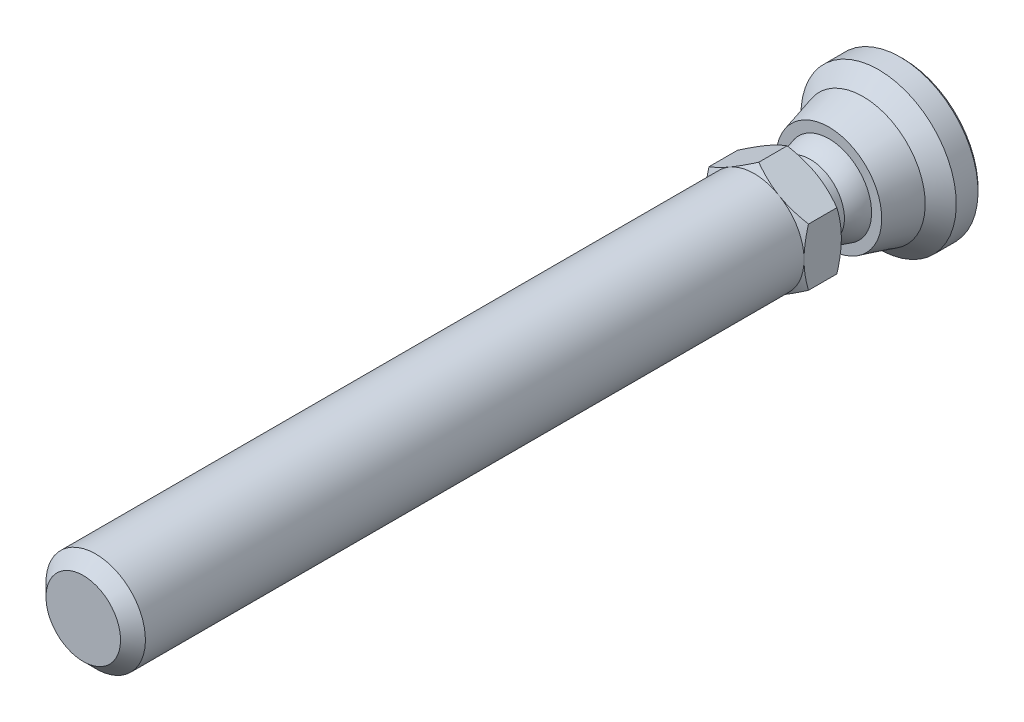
ISO-10303-21;
HEADER;
FILE_DESCRIPTION(('STEP AP214'),'2;1');
FILE_NAME('part.step','',(''),(''),'','','');
FILE_SCHEMA(('AUTOMOTIVE_DESIGN { 1 0 10303 214 1 1 1 1 }'));
ENDSEC;
DATA;
#1=APPLICATION_CONTEXT('core data for automotive mechanical design processes');
#2=APPLICATION_PROTOCOL_DEFINITION('international standard','automotive_design',2000,#1);
#3=PRODUCT_CONTEXT('',#1,'mechanical');
#4=PRODUCT('Part','Part','',(#3));
#5=PRODUCT_RELATED_PRODUCT_CATEGORY('part','',(#4));
#6=PRODUCT_DEFINITION_FORMATION('','',#4);
#7=PRODUCT_DEFINITION_CONTEXT('part definition',#1,'design');
#8=PRODUCT_DEFINITION('design','',#6,#7);
#9=PRODUCT_DEFINITION_SHAPE('','',#8);
#10=(LENGTH_UNIT() NAMED_UNIT(*) SI_UNIT(.MILLI.,.METRE.));
#11=(NAMED_UNIT(*) PLANE_ANGLE_UNIT() SI_UNIT($,.RADIAN.));
#12=(NAMED_UNIT(*) SI_UNIT($,.STERADIAN.) SOLID_ANGLE_UNIT());
#13=UNCERTAINTY_MEASURE_WITH_UNIT(LENGTH_MEASURE(1.E-05),#10,'distance_accuracy_value','');
#14=(GEOMETRIC_REPRESENTATION_CONTEXT(3) GLOBAL_UNCERTAINTY_ASSIGNED_CONTEXT((#13)) GLOBAL_UNIT_ASSIGNED_CONTEXT((#10,
#11,#12)) REPRESENTATION_CONTEXT('',''));
#15=CARTESIAN_POINT('',(0.,0.,0.));
#16=DIRECTION('',(0.,0.,1.));
#17=DIRECTION('',(1.,0.,0.));
#18=AXIS2_PLACEMENT_3D('',#15,#16,#17);
#19=CARTESIAN_POINT('',(-7.76470588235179,0.,17.9999999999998));
#20=DIRECTION('',(0.,0.,1.));
#21=DIRECTION('',(0.,-1.,0.));
#22=AXIS2_PLACEMENT_3D('',#19,#20,#21);
#23=PLANE('',#22);
#24=CARTESIAN_POINT('',(0.,0.,17.9999999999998));
#25=DIRECTION('',(0.,0.,-1.));
#26=DIRECTION('',(0.,1.,0.));
#27=AXIS2_PLACEMENT_3D('',#24,#25,#26);
#28=CIRCLE('',#27,5.49999999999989);
#29=CARTESIAN_POINT('',(0.,5.49999999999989,17.9999999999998));
#30=VERTEX_POINT('',#29);
#31=EDGE_CURVE('E256',#30,#30,#28,.T.);
#32=ORIENTED_EDGE('',*,*,#31,.F.);
#33=EDGE_LOOP('',(#32));
#34=FACE_BOUND('',#33,.T.);
#35=CARTESIAN_POINT('',(0.,0.,17.9999999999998));
#36=DIRECTION('',(0.,0.,1.));
#37=DIRECTION('',(0.,-1.,0.));
#38=AXIS2_PLACEMENT_3D('',#35,#36,#37);
#39=CIRCLE('',#38,7.99999999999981);
#40=CARTESIAN_POINT('',(3.99999999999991,-6.92820323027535,17.9999999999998));
#41=VERTEX_POINT('',#40);
#42=CARTESIAN_POINT('',(7.99999999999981,0.,17.9999999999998));
#43=VERTEX_POINT('',#42);
#44=EDGE_CURVE('E9',#41,#43,#39,.T.);
#45=ORIENTED_EDGE('',*,*,#44,.F.);
#46=CARTESIAN_POINT('',(-3.99999999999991,-6.92820323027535,17.9999999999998));
#47=VERTEX_POINT('',#46);
#48=EDGE_CURVE('E18',#47,#41,#39,.T.);
#49=ORIENTED_EDGE('',*,*,#48,.F.);
#50=CARTESIAN_POINT('',(-7.99999999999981,0.,17.9999999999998));
#51=VERTEX_POINT('',#50);
#52=EDGE_CURVE('E125',#51,#47,#39,.T.);
#53=ORIENTED_EDGE('',*,*,#52,.F.);
#54=CARTESIAN_POINT('',(-3.99999999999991,6.92820323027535,17.9999999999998));
#55=VERTEX_POINT('',#54);
#56=EDGE_CURVE('E593',#55,#51,#39,.T.);
#57=ORIENTED_EDGE('',*,*,#56,.F.);
#58=CARTESIAN_POINT('',(3.99999999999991,6.92820323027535,17.9999999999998));
#59=VERTEX_POINT('',#58);
#60=EDGE_CURVE('E23',#59,#55,#39,.T.);
#61=ORIENTED_EDGE('',*,*,#60,.F.);
#62=CARTESIAN_POINT('',(0.,0.,17.9999999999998));
#63=DIRECTION('',(0.,0.,-1.));
#64=DIRECTION('',(0.,1.,0.));
#65=AXIS2_PLACEMENT_3D('',#62,#63,#64);
#66=CIRCLE('',#65,7.99999999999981);
#67=EDGE_CURVE('E128',#59,#43,#66,.T.);
#68=ORIENTED_EDGE('',*,*,#67,.T.);
#69=EDGE_LOOP('',(#45,#49,#53,#57,#61,#68));
#70=FACE_BOUND('',#69,.T.);
#71=ADVANCED_FACE('F14',(#34,#70),#23,.F.);
#72=CARTESIAN_POINT('',(0.,0.,0.5));
#73=DIRECTION('',(0.,0.,1.));
#74=DIRECTION('',(0.,-1.,0.));
#75=AXIS2_PLACEMENT_3D('',#72,#73,#74);
#76=CONICAL_SURFACE('',#75,12.5,0.785398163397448);
#77=CARTESIAN_POINT('',(0.,0.,0.));
#78=DIRECTION('',(0.,0.,-1.));
#79=DIRECTION('',(0.,1.,0.));
#80=AXIS2_PLACEMENT_3D('',#77,#78,#79);
#81=CIRCLE('',#80,12.);
#82=CARTESIAN_POINT('',(0.,12.,0.));
#83=VERTEX_POINT('',#82);
#84=EDGE_CURVE('E265',#83,#83,#81,.T.);
#85=ORIENTED_EDGE('',*,*,#84,.F.);
#86=EDGE_LOOP('',(#85));
#87=FACE_BOUND('',#86,.T.);
#88=CARTESIAN_POINT('',(0.,0.,0.5));
#89=DIRECTION('',(0.,0.,-1.));
#90=DIRECTION('',(0.,1.,0.));
#91=AXIS2_PLACEMENT_3D('',#88,#89,#90);
#92=CIRCLE('',#91,12.5);
#93=CARTESIAN_POINT('',(0.,12.5,0.5));
#94=VERTEX_POINT('',#93);
#95=EDGE_CURVE('E226',#94,#94,#92,.T.);
#96=ORIENTED_EDGE('',*,*,#95,.T.);
#97=EDGE_LOOP('',(#96));
#98=FACE_BOUND('',#97,.T.);
#99=ADVANCED_FACE('F16',(#87,#98),#76,.T.);
#100=CARTESIAN_POINT('',(-12.,0.,0.));
#101=DIRECTION('',(0.,0.,1.));
#102=DIRECTION('',(0.,-1.,0.));
#103=AXIS2_PLACEMENT_3D('',#100,#101,#102);
#104=PLANE('',#103);
#105=ORIENTED_EDGE('',*,*,#84,.T.);
#106=EDGE_LOOP('',(#105));
#107=FACE_BOUND('',#106,.T.);
#108=ADVANCED_FACE('F361',(#107),#104,.F.);
#109=CARTESIAN_POINT('',(0.,0.,0.));
#110=DIRECTION('',(0.,0.,-1.));
#111=DIRECTION('',(0.,1.,0.));
#112=AXIS2_PLACEMENT_3D('',#109,#110,#111);
#113=CYLINDRICAL_SURFACE('',#112,5.4999999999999);
#114=CARTESIAN_POINT('',(0.,0.,15.));
#115=DIRECTION('',(0.,0.,-1.));
#116=DIRECTION('',(0.,1.,0.));
#117=AXIS2_PLACEMENT_3D('',#114,#115,#116);
#118=CIRCLE('',#117,5.4999999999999);
#119=CARTESIAN_POINT('',(-5.49999999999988,0.,15.));
#120=VERTEX_POINT('',#119);
#121=EDGE_CURVE('E253',#120,#120,#118,.T.);
#122=ORIENTED_EDGE('',*,*,#121,.F.);
#123=EDGE_LOOP('',(#122));
#124=FACE_BOUND('',#123,.T.);
#125=ORIENTED_EDGE('',*,*,#31,.T.);
#126=EDGE_LOOP('',(#125));
#127=FACE_BOUND('',#126,.T.);
#128=ADVANCED_FACE('F357',(#124,#127),#113,.T.);
#129=CARTESIAN_POINT('',(1.11022302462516E-13,0.,10.6698729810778));
#130=DIRECTION('',(0.,0.,-1.));
#131=DIRECTION('',(-1.,0.,0.));
#132=AXIS2_PLACEMENT_3D('',#129,#130,#131);
#133=SPHERICAL_SURFACE('',#132,7.);
#134=CARTESIAN_POINT('',(0.,0.,12.));
#135=DIRECTION('',(0.,0.,-1.));
#136=DIRECTION('',(0.,1.,0.));
#137=AXIS2_PLACEMENT_3D('',#134,#135,#136);
#138=CIRCLE('',#137,6.87246404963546);
#139=CARTESIAN_POINT('',(-6.87246404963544,0.,12.));
#140=VERTEX_POINT('',#139);
#141=EDGE_CURVE('E250',#140,#140,#138,.T.);
#142=CARTESIAN_POINT('',(-6.87246404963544,0.,12.));
#143=CARTESIAN_POINT('',(-6.86587210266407,0.,12.0340591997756));
#144=CARTESIAN_POINT('',(-6.85902692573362,0.,12.0680693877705));
#145=CARTESIAN_POINT('',(-6.84483171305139,0.,12.1359842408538));
#146=CARTESIAN_POINT('',(-6.83748167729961,0.,12.1698889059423));
#147=CARTESIAN_POINT('',(-6.82227834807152,0.,12.2375852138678));
#148=CARTESIAN_POINT('',(-6.81442505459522,0.,12.2713768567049));
#149=CARTESIAN_POINT('',(-6.79821695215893,0.,12.3388396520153));
#150=CARTESIAN_POINT('',(-6.78986214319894,0.,12.3725108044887));
#151=CARTESIAN_POINT('',(-6.77265285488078,0.,12.4397251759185));
#152=CARTESIAN_POINT('',(-6.76379837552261,0.,12.473268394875));
#153=CARTESIAN_POINT('',(-6.7455917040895,0.,12.5402194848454));
#154=CARTESIAN_POINT('',(-6.73623951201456,0.,12.5736273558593));
#155=CARTESIAN_POINT('',(-6.71703948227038,0.,12.6403003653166));
#156=CARTESIAN_POINT('',(-6.70719164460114,0.,12.67356550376));
#157=CARTESIAN_POINT('',(-6.68700250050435,0.,12.7399456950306));
#158=CARTESIAN_POINT('',(-6.6766611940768,0.,12.7730607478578));
#159=CARTESIAN_POINT('',(-6.65548739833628,0.,12.8391334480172));
#160=CARTESIAN_POINT('',(-6.64465490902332,0.,12.8720910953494));
#161=CARTESIAN_POINT('',(-6.62250114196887,0.,12.9378416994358));
#162=CARTESIAN_POINT('',(-6.61117986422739,0.,12.9706346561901));
#163=CARTESIAN_POINT('',(-6.58805102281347,0.,13.0360486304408));
#164=CARTESIAN_POINT('',(-6.57624345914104,0.,13.0686696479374));
#165=CARTESIAN_POINT('',(-6.55214465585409,0.,13.1337325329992));
#166=CARTESIAN_POINT('',(-6.53985341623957,0.,13.1661744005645));
#167=CARTESIAN_POINT('',(-6.51478997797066,0.,13.2308718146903));
#168=CARTESIAN_POINT('',(-6.50201777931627,0.,13.2631273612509));
#169=CARTESIAN_POINT('',(-6.47599524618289,0.,13.3274450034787));
#170=CARTESIAN_POINT('',(-6.46274491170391,0.,13.3595070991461));
#171=CARTESIAN_POINT('',(-6.43576903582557,0.,13.4234307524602));
#172=CARTESIAN_POINT('',(-6.42204349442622,0.,13.455292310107));
#173=CARTESIAN_POINT('',(-6.3941202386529,0.,13.5188078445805));
#174=CARTESIAN_POINT('',(-6.37992252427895,0.,13.5504618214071));
#175=CARTESIAN_POINT('',(-6.3510580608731,0.,13.6135551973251));
#176=CARTESIAN_POINT('',(-6.33639131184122,0.,13.6449945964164));
#177=CARTESIAN_POINT('',(-6.3065920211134,0.,13.7076518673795));
#178=CARTESIAN_POINT('',(-6.29145947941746,0.,13.7388697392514));
#179=CARTESIAN_POINT('',(-6.26073194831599,0.,13.8010770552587));
#180=CARTESIAN_POINT('',(-6.24513695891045,0.,13.8320664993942));
#181=CARTESIAN_POINT('',(-6.21348797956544,0.,13.8938101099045));
#182=CARTESIAN_POINT('',(-6.19743398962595,0.,13.9245642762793));
#183=CARTESIAN_POINT('',(-6.16487055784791,0.,13.9858305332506));
#184=CARTESIAN_POINT('',(-6.14836111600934,0.,14.016342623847));
#185=CARTESIAN_POINT('',(-6.11489042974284,0.,14.0771179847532));
#186=CARTESIAN_POINT('',(-6.09792918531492,0.,14.107381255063));
#187=CARTESIAN_POINT('',(-6.06355864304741,0.,14.1676522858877));
#188=CARTESIAN_POINT('',(-6.04614934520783,0.,14.1976600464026));
#189=CARTESIAN_POINT('',(-6.01088654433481,0.,14.2574134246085));
#190=CARTESIAN_POINT('',(-5.99303304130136,0.,14.2871590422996));
#191=CARTESIAN_POINT('',(-5.95688577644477,0.,14.3463815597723));
#192=CARTESIAN_POINT('',(-5.93859201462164,0.,14.3758584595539));
#193=CARTESIAN_POINT('',(-5.9015682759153,0.,14.4345370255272));
#194=CARTESIAN_POINT('',(-5.88283829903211,0.,14.4637386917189));
#195=CARTESIAN_POINT('',(-5.8449462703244,0.,14.5218603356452));
#196=CARTESIAN_POINT('',(-5.82578421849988,0.,14.5507803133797));
#197=CARTESIAN_POINT('',(-5.7870322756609,0.,14.6083321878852));
#198=CARTESIAN_POINT('',(-5.76744238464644,0.,14.6369640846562));
#199=CARTESIAN_POINT('',(-5.72783909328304,0.,14.6939334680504));
#200=CARTESIAN_POINT('',(-5.7078256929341,0.,14.7222709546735));
#201=CARTESIAN_POINT('',(-5.66737980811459,0.,14.778645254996));
#202=CARTESIAN_POINT('',(-5.64694732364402,0.,14.8066820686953));
#203=CARTESIAN_POINT('',(-5.60566778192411,0.,14.862448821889));
#204=CARTESIAN_POINT('',(-5.58482072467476,0.,14.8901787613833));
#205=CARTESIAN_POINT('',(-5.54271666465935,0.,14.9453256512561));
#206=CARTESIAN_POINT('',(-5.52145966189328,0.,14.9727426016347));
#207=CARTESIAN_POINT('',(-5.49999999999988,0.,15.));
#208=B_SPLINE_CURVE_WITH_KNOTS('',3,(#142,#143,#144,#145,#146,#147,#148,#149,#150,#151,#152,
#153,#154,#155,#156,#157,#158,#159,#160,#161,#162,#163,#164,#165,#166,#167,#168,#169,#170,#171,
#172,#173,#174,#175,#176,#177,#178,#179,#180,#181,#182,#183,#184,#185,#186,#187,#188,#189,#190,
#191,#192,#193,#194,#195,#196,#197,#198,#199,#200,#201,#202,#203,#204,#205,#206,#207),
.UNSPECIFIED.,.F.,.F.,(4,2,2,2,2,2,2,2,2,2,2,2,2,2,2,2,2,2,2,2,2,2,2,2,2,2,2,2,2,2,2,2,4),(0.,
0.104072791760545,0.208145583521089,0.312218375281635,0.416291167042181,0.520363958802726,
0.62443675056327,0.728509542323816,0.83258233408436,0.936655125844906,1.04072791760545,
1.144800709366,1.24887350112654,1.35294629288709,1.45701908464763,1.56109187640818,
1.66516466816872,1.76923745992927,1.87331025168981,1.97738304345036,2.0814558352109,
2.18552862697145,2.28960141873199,2.39367421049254,2.49774700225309,2.60181979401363,
2.70589258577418,2.80996537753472,2.91403816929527,3.01811096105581,3.12218375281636,
3.2262565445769,3.33032933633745),.UNSPECIFIED.);
#209=EDGE_CURVE('BSEAM353',#140,#120,#208,.T.);
#210=ORIENTED_EDGE('',*,*,#141,.F.);
#211=ORIENTED_EDGE('',*,*,#121,.T.);
#212=ORIENTED_EDGE('',*,*,#209,.T.);
#213=ORIENTED_EDGE('',*,*,#209,.F.);
#214=EDGE_LOOP('',(#210,#212,#211,#213));
#215=FACE_BOUND('',#214,.T.);
#216=ADVANCED_FACE('F353',(#215),#133,.T.);
#217=CARTESIAN_POINT('',(-8.5,0.,12.));
#218=DIRECTION('',(0.,0.,-1.));
#219=DIRECTION('',(0.,1.,0.));
#220=AXIS2_PLACEMENT_3D('',#217,#218,#219);
#221=PLANE('',#220);
#222=CARTESIAN_POINT('',(0.,0.,12.));
#223=DIRECTION('',(0.,0.,-1.));
#224=DIRECTION('',(0.,1.,0.));
#225=AXIS2_PLACEMENT_3D('',#222,#223,#224);
#226=CIRCLE('',#225,8.5);
#227=CARTESIAN_POINT('',(0.,8.5,12.));
#228=VERTEX_POINT('',#227);
#229=EDGE_CURVE('E247',#228,#228,#226,.T.);
#230=ORIENTED_EDGE('',*,*,#229,.F.);
#231=EDGE_LOOP('',(#230));
#232=FACE_BOUND('',#231,.T.);
#233=ORIENTED_EDGE('',*,*,#141,.T.);
#234=EDGE_LOOP('',(#233));
#235=FACE_BOUND('',#234,.T.);
#236=ADVANCED_FACE('F349',(#232,#235),#221,.F.);
#237=CARTESIAN_POINT('',(0.,0.,12.));
#238=DIRECTION('',(0.,0.,-1.));
#239=DIRECTION('',(0.,1.,0.));
#240=AXIS2_PLACEMENT_3D('',#237,#238,#239);
#241=CONICAL_SURFACE('',#240,8.5,0.266252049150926);
#242=CARTESIAN_POINT('',(0.,0.,6.5));
#243=DIRECTION('',(0.,0.,-1.));
#244=DIRECTION('',(0.,1.,0.));
#245=AXIS2_PLACEMENT_3D('',#242,#243,#244);
#246=CIRCLE('',#245,10.);
#247=CARTESIAN_POINT('',(0.,10.,6.5));
#248=VERTEX_POINT('',#247);
#249=EDGE_CURVE('E244',#248,#248,#246,.T.);
#250=ORIENTED_EDGE('',*,*,#249,.F.);
#251=EDGE_LOOP('',(#250));
#252=FACE_BOUND('',#251,.T.);
#253=ORIENTED_EDGE('',*,*,#229,.T.);
#254=EDGE_LOOP('',(#253));
#255=FACE_BOUND('',#254,.T.);
#256=ADVANCED_FACE('F345',(#252,#255),#241,.T.);
#257=CARTESIAN_POINT('',(0.,0.,6.5));
#258=DIRECTION('',(0.,0.,-1.));
#259=DIRECTION('',(0.,1.,0.));
#260=AXIS2_PLACEMENT_3D('',#257,#258,#259);
#261=CONICAL_SURFACE('',#260,10.,0.785398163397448);
#262=CARTESIAN_POINT('',(0.,0.,4.));
#263=DIRECTION('',(0.,0.,-1.));
#264=DIRECTION('',(0.,1.,0.));
#265=AXIS2_PLACEMENT_3D('',#262,#263,#264);
#266=CIRCLE('',#265,12.5);
#267=CARTESIAN_POINT('',(0.,12.5,4.));
#268=VERTEX_POINT('',#267);
#269=EDGE_CURVE('E241',#268,#268,#266,.T.);
#270=ORIENTED_EDGE('',*,*,#269,.F.);
#271=EDGE_LOOP('',(#270));
#272=FACE_BOUND('',#271,.T.);
#273=ORIENTED_EDGE('',*,*,#249,.T.);
#274=EDGE_LOOP('',(#273));
#275=FACE_BOUND('',#274,.T.);
#276=ADVANCED_FACE('F341',(#272,#275),#261,.T.);
#277=CARTESIAN_POINT('',(0.,0.,0.));
#278=DIRECTION('',(0.,0.,-1.));
#279=DIRECTION('',(0.,1.,0.));
#280=AXIS2_PLACEMENT_3D('',#277,#278,#279);
#281=CYLINDRICAL_SURFACE('',#280,12.5);
#282=ORIENTED_EDGE('',*,*,#95,.F.);
#283=EDGE_LOOP('',(#282));
#284=FACE_BOUND('',#283,.T.);
#285=ORIENTED_EDGE('',*,*,#269,.T.);
#286=EDGE_LOOP('',(#285));
#287=FACE_BOUND('',#286,.T.);
#288=ADVANCED_FACE('F333',(#284,#287),#281,.T.);
#289=CARTESIAN_POINT('',(0.,0.,17.9999999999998));
#290=DIRECTION('',(0.,0.,1.));
#291=DIRECTION('',(0.,-1.,0.));
#292=AXIS2_PLACEMENT_3D('',#289,#290,#291);
#293=CONICAL_SURFACE('',#292,7.99999999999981,1.0471975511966);
#294=ORIENTED_EDGE('',*,*,#48,.T.);
#295=CARTESIAN_POINT('',(-0.000199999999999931,-9.23771977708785,18.7145978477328));
#296=CARTESIAN_POINT('',(0.175648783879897,-9.13619343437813,18.6559907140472));
#297=CARTESIAN_POINT('',(0.352153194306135,-9.03428856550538,18.6000434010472));
#298=CARTESIAN_POINT('',(0.70659546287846,-8.82965122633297,18.4942010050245));
#299=CARTESIAN_POINT('',(0.884533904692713,-8.72691841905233,18.4443085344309));
#300=CARTESIAN_POINT('',(1.42119823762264,-8.41707512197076,18.3046927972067));
#301=CARTESIAN_POINT('',(1.78204258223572,-8.20874154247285,18.2252811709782));
#302=CARTESIAN_POINT('',(2.32203917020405,-7.89697436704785,18.1321616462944));
#303=CARTESIAN_POINT('',(2.49957818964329,-7.79447216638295,18.105634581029));
#304=CARTESIAN_POINT('',(2.8554591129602,-7.58900421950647,18.0611531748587));
#305=CARTESIAN_POINT('',(3.03380094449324,-7.4860385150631,18.0431980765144));
#306=CARTESIAN_POINT('',(3.3907916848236,-7.27992981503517,18.0163156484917));
#307=CARTESIAN_POINT('',(3.5694400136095,-7.17678715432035,18.0073780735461));
#308=CARTESIAN_POINT('',(3.92690170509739,-6.97040655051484,17.998722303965));
#309=CARTESIAN_POINT('',(4.10571506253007,-6.86716861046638,17.9990038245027));
#310=CARTESIAN_POINT('',(4.44001336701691,-6.67416139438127,18.0081450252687));
#311=CARTESIAN_POINT('',(4.59552190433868,-6.58437849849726,18.0158896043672));
#312=CARTESIAN_POINT('',(4.90617476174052,-6.40502298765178,18.0382011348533));
#313=CARTESIAN_POINT('',(5.06131905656,-6.31545038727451,18.052768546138));
#314=CARTESIAN_POINT('',(5.52615131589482,-6.04707935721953,18.1063606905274));
#315=CARTESIAN_POINT('',(5.83501648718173,-5.86875596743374,18.155268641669));
#316=CARTESIAN_POINT('',(6.4560232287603,-5.51021755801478,18.2775394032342));
#317=CARTESIAN_POINT('',(6.76808554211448,-5.33004829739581,18.3514205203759));
#318=CARTESIAN_POINT('',(7.38755648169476,-4.97239658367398,18.5191001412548));
#319=CARTESIAN_POINT('',(7.69497304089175,-4.79490955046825,18.6128592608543));
#320=CARTESIAN_POINT('',(8.0002,-4.61868668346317,18.7145978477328));
#321=B_SPLINE_CURVE_WITH_KNOTS('',3,(#295,#296,#297,#298,#299,#300,#301,#302,#303,#304,#305,
#306,#307,#308,#309,#310,#311,#312,#313,#314,#315,#316,#317,#318,#319,#320),.UNSPECIFIED.,.F.,
.F.,(4,2,2,2,2,2,2,2,2,2,2,2,4),(0.,0.633973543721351,1.26821965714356,2.53934712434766,
3.15934343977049,3.77928496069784,4.39852133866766,5.01773858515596,5.55680239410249,
6.09590254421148,7.17487077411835,8.27776850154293,9.37850115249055),.UNSPECIFIED.);
#322=CARTESIAN_POINT('',(0.,-9.23760430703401,18.7145311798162));
#323=VERTEX_POINT('',#322);
#324=EDGE_CURVE('E114',#323,#41,#321,.T.);
#325=ORIENTED_EDGE('',*,*,#324,.F.);
#326=CARTESIAN_POINT('',(-8.0002,-4.61868668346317,18.7145978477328));
#327=CARTESIAN_POINT('',(-7.8243512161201,-4.72021302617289,18.6559907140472));
#328=CARTESIAN_POINT('',(-7.64784680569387,-4.82211789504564,18.6000434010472));
#329=CARTESIAN_POINT('',(-7.29340453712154,-5.02675523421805,18.4942010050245));
#330=CARTESIAN_POINT('',(-7.11546609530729,-5.12948804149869,18.4443085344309));
#331=CARTESIAN_POINT('',(-6.57880176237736,-5.43933133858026,18.3046927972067));
#332=CARTESIAN_POINT('',(-6.21795741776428,-5.64766491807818,18.2252811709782));
#333=CARTESIAN_POINT('',(-5.67796082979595,-5.95943209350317,18.1321616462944));
#334=CARTESIAN_POINT('',(-5.50042181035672,-6.06193429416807,18.105634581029));
#335=CARTESIAN_POINT('',(-5.1445408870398,-6.26740224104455,18.0611531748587));
#336=CARTESIAN_POINT('',(-4.96619905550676,-6.37036794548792,18.0431980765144));
#337=CARTESIAN_POINT('',(-4.60920831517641,-6.57647664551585,18.0163156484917));
#338=CARTESIAN_POINT('',(-4.4305599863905,-6.67961930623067,18.0073780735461));
#339=CARTESIAN_POINT('',(-4.07309829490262,-6.88599991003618,17.998722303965));
#340=CARTESIAN_POINT('',(-3.89428493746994,-6.98923785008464,17.9990038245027));
#341=CARTESIAN_POINT('',(-3.5599866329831,-7.18224506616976,18.0081450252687));
#342=CARTESIAN_POINT('',(-3.40447809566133,-7.27202796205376,18.0158896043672));
#343=CARTESIAN_POINT('',(-3.09382523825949,-7.45138347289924,18.0382011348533));
#344=CARTESIAN_POINT('',(-2.93868094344,-7.54095607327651,18.052768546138));
#345=CARTESIAN_POINT('',(-2.47384868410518,-7.80932710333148,18.1063606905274));
#346=CARTESIAN_POINT('',(-2.16498351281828,-7.98765049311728,18.155268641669));
#347=CARTESIAN_POINT('',(-1.5439767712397,-8.34618890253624,18.2775394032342));
#348=CARTESIAN_POINT('',(-1.23191445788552,-8.52635816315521,18.3514205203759));
#349=CARTESIAN_POINT('',(-0.612443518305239,-8.88400987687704,18.5191001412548));
#350=CARTESIAN_POINT('',(-0.305026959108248,-9.06149691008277,18.6128592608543));
#351=CARTESIAN_POINT('',(0.000200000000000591,-9.23771977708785,18.7145978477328));
#352=B_SPLINE_CURVE_WITH_KNOTS('',3,(#326,#327,#328,#329,#330,#331,#332,#333,#334,#335,#336,
#337,#338,#339,#340,#341,#342,#343,#344,#345,#346,#347,#348,#349,#350,#351),.UNSPECIFIED.,.F.,
.F.,(4,2,2,2,2,2,2,2,2,2,2,2,4),(0.,0.633973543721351,1.26821965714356,2.53934712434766,
3.15934343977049,3.77928496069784,4.39852133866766,5.01773858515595,5.55680239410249,
6.09590254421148,7.17487077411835,8.27776850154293,9.37850115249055),.UNSPECIFIED.);
#353=EDGE_CURVE('E121',#47,#323,#352,.T.);
#354=ORIENTED_EDGE('',*,*,#353,.F.);
#355=EDGE_LOOP('',(#294,#325,#354));
#356=FACE_BOUND('',#355,.T.);
#357=ADVANCED_FACE('F119',(#356),#293,.T.);
#358=ORIENTED_EDGE('',*,*,#52,.T.);
#359=CARTESIAN_POINT('',(-8.,-4.61880215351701,18.7145311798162));
#360=VERTEX_POINT('',#359);
#361=EDGE_CURVE('E134',#360,#47,#352,.T.);
#362=ORIENTED_EDGE('',*,*,#361,.F.);
#363=CARTESIAN_POINT('',(-8.,12.3857716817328,21.8940771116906));
#364=CARTESIAN_POINT('',(-8.,12.0365403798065,21.7247527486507));
#365=CARTESIAN_POINT('',(-8.,11.6865051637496,21.5570579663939));
#366=CARTESIAN_POINT('',(-8.,10.9843993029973,21.2258444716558));
#367=CARTESIAN_POINT('',(-8.,10.6323283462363,21.0623264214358));
#368=CARTESIAN_POINT('',(-8.,9.92389932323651,20.7395561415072));
#369=CARTESIAN_POINT('',(-8.,9.56752833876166,20.5803321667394));
#370=CARTESIAN_POINT('',(-8.,8.85194473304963,20.2684279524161));
#371=CARTESIAN_POINT('',(-8.,8.49273224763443,20.1157474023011));
#372=CARTESIAN_POINT('',(-8.,7.75936630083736,19.8139137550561));
#373=CARTESIAN_POINT('',(-8.,7.38510188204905,19.6650287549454));
#374=CARTESIAN_POINT('',(-8.,6.63218755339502,19.3785775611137));
#375=CARTESIAN_POINT('',(-8.,6.25353715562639,19.2410126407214));
#376=CARTESIAN_POINT('',(-8.,5.49195943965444,18.9808287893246));
#377=CARTESIAN_POINT('',(-8.,5.10904263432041,18.8581794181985));
#378=CARTESIAN_POINT('',(-8.,4.33773010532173,18.6317744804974));
#379=CARTESIAN_POINT('',(-8.,3.94933615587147,18.5280129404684));
#380=CARTESIAN_POINT('',(-8.,3.16894345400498,18.3449365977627));
#381=CARTESIAN_POINT('',(-8.,2.77697658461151,18.2654895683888));
#382=CARTESIAN_POINT('',(-8.,2.18547358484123,18.1680031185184));
#383=CARTESIAN_POINT('',(-8.,1.98769908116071,18.139120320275));
#384=CARTESIAN_POINT('',(-8.,1.59117415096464,18.0891497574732));
#385=CARTESIAN_POINT('',(-8.,1.39242382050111,18.0680612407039));
#386=CARTESIAN_POINT('',(-8.,0.996800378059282,18.0343627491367));
#387=CARTESIAN_POINT('',(-8.,0.799936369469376,18.0216463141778));
#388=CARTESIAN_POINT('',(-8.,0.405847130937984,18.0045483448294));
#389=CARTESIAN_POINT('',(-8.,0.208621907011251,18.0001666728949));
#390=CARTESIAN_POINT('',(-8.,-0.185837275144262,17.9998426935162));
#391=CARTESIAN_POINT('',(-8.,-0.383071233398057,18.0039004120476));
#392=CARTESIAN_POINT('',(-8.,-0.777193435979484,18.0203563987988));
#393=CARTESIAN_POINT('',(-8.,-0.974081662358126,18.0327550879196));
#394=CARTESIAN_POINT('',(-8.,-1.44791100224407,18.0723689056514));
#395=CARTESIAN_POINT('',(-8.,-1.72452522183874,18.1035774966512));
#396=CARTESIAN_POINT('',(-8.,-2.27567376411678,18.1807506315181));
#397=CARTESIAN_POINT('',(-8.,-2.55020779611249,18.2267172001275));
#398=CARTESIAN_POINT('',(-8.,-3.37039175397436,18.3843141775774));
#399=CARTESIAN_POINT('',(-8.,-3.91231106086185,18.5156123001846));
#400=CARTESIAN_POINT('',(-8.,-4.72257114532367,18.7429535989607));
#401=CARTESIAN_POINT('',(-8.,-4.99512372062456,18.824846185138));
#402=CARTESIAN_POINT('',(-8.,-5.53758119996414,18.9970533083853));
#403=CARTESIAN_POINT('',(-8.,-5.80748608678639,19.0873679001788));
#404=CARTESIAN_POINT('',(-8.,-6.34473443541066,19.2749769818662));
#405=CARTESIAN_POINT('',(-8.,-6.61207872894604,19.372269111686));
#406=CARTESIAN_POINT('',(-8.,-7.14455823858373,19.5726969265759));
#407=CARTESIAN_POINT('',(-8.,-7.40969347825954,19.6758325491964));
#408=CARTESIAN_POINT('',(-8.,-8.02577057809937,19.9220542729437));
#409=CARTESIAN_POINT('',(-8.,-8.3759559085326,20.0670295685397));
#410=CARTESIAN_POINT('',(-8.,-9.07342011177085,20.3638301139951));
#411=CARTESIAN_POINT('',(-8.,-9.42069881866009,20.5156557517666));
#412=CARTESIAN_POINT('',(-8.,-10.1128777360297,20.8248126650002));
#413=CARTESIAN_POINT('',(-8.,-10.4577774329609,20.9821450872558));
#414=CARTESIAN_POINT('',(-8.,-11.1455140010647,21.3012278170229));
#415=CARTESIAN_POINT('',(-8.,-11.4883509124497,21.4629780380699));
#416=CARTESIAN_POINT('',(-8.,-12.1726534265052,21.7902547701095));
#417=CARTESIAN_POINT('',(-8.,-12.5141172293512,21.9557850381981));
#418=CARTESIAN_POINT('',(-8.,-13.1955839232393,22.2898286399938));
#419=CARTESIAN_POINT('',(-8.,-13.5355868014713,22.4583419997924));
#420=CARTESIAN_POINT('',(-8.,-14.5536612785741,22.9675348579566));
#421=CARTESIAN_POINT('',(-8.,-15.2298849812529,23.3119087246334));
#422=CARTESIAN_POINT('',(-8.,-16.5236966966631,23.9792412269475));
#423=CARTESIAN_POINT('',(-8.,-17.1415671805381,24.3016546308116));
#424=CARTESIAN_POINT('',(-8.,-18.3749905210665,24.9509305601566));
#425=CARTESIAN_POINT('',(-8.,-18.9905433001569,25.2777932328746));
#426=CARTESIAN_POINT('',(-8.,-20.218358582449,25.9341286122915));
#427=CARTESIAN_POINT('',(-8.,-20.8306254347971,26.2635931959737));
#428=CARTESIAN_POINT('',(-8.,-22.0536712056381,26.9251964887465));
#429=CARTESIAN_POINT('',(-8.,-22.6644502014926,27.2573350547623));
#430=CARTESIAN_POINT('',(-8.,-23.2746787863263,27.5904750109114));
#431=B_SPLINE_CURVE_WITH_KNOTS('',3,(#363,#364,#365,#366,#367,#368,#369,#370,#371,#372,#373,
#374,#375,#376,#377,#378,#379,#380,#381,#382,#383,#384,#385,#386,#387,#388,#389,#390,#391,#392,
#393,#394,#395,#396,#397,#398,#399,#400,#401,#402,#403,#404,#405,#406,#407,#408,#409,#410,#411,
#412,#413,#414,#415,#416,#417,#418,#419,#420,#421,#422,#423,#424,#425,#426,#427,#428,#429,#430),
.UNSPECIFIED.,.F.,.F.,(4,2,2,2,2,2,2,2,2,2,2,2,2,2,2,2,2,2,2,2,2,2,2,2,2,2,2,2,2,2,2,2,2,4),(0.,
1.16435927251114,2.32890203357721,3.49982028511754,4.67068290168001,5.87891385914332,
7.08728053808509,8.29313821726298,9.49861386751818,10.6974124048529,11.2969001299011,
11.8963299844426,12.4879821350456,13.079624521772,13.6712687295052,14.26294279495,
15.0975782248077,15.9323282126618,17.6027655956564,18.4564645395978,19.3101690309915,
20.1635861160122,21.0169940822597,22.1539230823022,23.2909165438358,24.4281482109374,
25.5653576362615,26.7037513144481,27.8421549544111,30.1186749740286,32.2094518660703,
34.3002981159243,36.3861382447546,38.471867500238),.UNSPECIFIED.);
#432=EDGE_CURVE('E176',#51,#360,#431,.T.);
#433=ORIENTED_EDGE('',*,*,#432,.F.);
#434=EDGE_LOOP('',(#358,#362,#433));
#435=FACE_BOUND('',#434,.T.);
#436=ADVANCED_FACE('F474',(#435),#293,.T.);
#437=ORIENTED_EDGE('',*,*,#56,.T.);
#438=CARTESIAN_POINT('',(-8.,4.61880215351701,18.7145311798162));
#439=VERTEX_POINT('',#438);
#440=EDGE_CURVE('E182',#439,#51,#431,.T.);
#441=ORIENTED_EDGE('',*,*,#440,.F.);
#442=CARTESIAN_POINT('',(0.000200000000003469,9.23771977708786,18.7145978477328));
#443=CARTESIAN_POINT('',(-0.175648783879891,9.13619343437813,18.6559907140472));
#444=CARTESIAN_POINT('',(-0.352153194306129,9.03428856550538,18.6000434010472));
#445=CARTESIAN_POINT('',(-0.706595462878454,8.82965122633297,18.4942010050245));
#446=CARTESIAN_POINT('',(-0.884533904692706,8.72691841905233,18.4443085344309));
#447=CARTESIAN_POINT('',(-1.42119823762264,8.41707512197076,18.3046927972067));
#448=CARTESIAN_POINT('',(-1.78204258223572,8.20874154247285,18.2252811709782));
#449=CARTESIAN_POINT('',(-2.32203917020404,7.89697436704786,18.1321616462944));
#450=CARTESIAN_POINT('',(-2.49957818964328,7.79447216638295,18.105634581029));
#451=CARTESIAN_POINT('',(-2.85545911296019,7.58900421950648,18.0611531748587));
#452=CARTESIAN_POINT('',(-3.03380094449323,7.48603851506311,18.0431980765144));
#453=CARTESIAN_POINT('',(-3.39079168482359,7.27992981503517,18.0163156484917));
#454=CARTESIAN_POINT('',(-3.5694400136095,7.17678715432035,18.0073780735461));
#455=CARTESIAN_POINT('',(-3.92690170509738,6.97040655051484,17.998722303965));
#456=CARTESIAN_POINT('',(-4.10571506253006,6.86716861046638,17.9990038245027));
#457=CARTESIAN_POINT('',(-4.4400133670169,6.67416139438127,18.0081450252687));
#458=CARTESIAN_POINT('',(-4.59552190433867,6.58437849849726,18.0158896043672));
#459=CARTESIAN_POINT('',(-4.90617476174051,6.40502298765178,18.0382011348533));
#460=CARTESIAN_POINT('',(-5.06131905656,6.31545038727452,18.052768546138));
#461=CARTESIAN_POINT('',(-5.52615131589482,6.04707935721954,18.1063606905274));
#462=CARTESIAN_POINT('',(-5.83501648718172,5.86875596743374,18.155268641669));
#463=CARTESIAN_POINT('',(-6.4560232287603,5.51021755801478,18.2775394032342));
#464=CARTESIAN_POINT('',(-6.76808554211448,5.33004829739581,18.3514205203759));
#465=CARTESIAN_POINT('',(-7.38755648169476,4.97239658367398,18.5191001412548));
#466=CARTESIAN_POINT('',(-7.69497304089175,4.79490955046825,18.6128592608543));
#467=CARTESIAN_POINT('',(-8.0002,4.61868668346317,18.7145978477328));
#468=B_SPLINE_CURVE_WITH_KNOTS('',3,(#442,#443,#444,#445,#446,#447,#448,#449,#450,#451,#452,
#453,#454,#455,#456,#457,#458,#459,#460,#461,#462,#463,#464,#465,#466,#467),.UNSPECIFIED.,.F.,
.F.,(4,2,2,2,2,2,2,2,2,2,2,2,4),(0.,0.633973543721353,1.26821965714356,2.53934712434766,
3.15934343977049,3.77928496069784,4.39852133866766,5.01773858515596,5.5568023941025,
6.09590254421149,7.17487077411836,8.27776850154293,9.37850115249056),.UNSPECIFIED.);
#469=EDGE_CURVE('E183',#55,#439,#468,.T.);
#470=ORIENTED_EDGE('',*,*,#469,.F.);
#471=EDGE_LOOP('',(#437,#441,#470));
#472=FACE_BOUND('',#471,.T.);
#473=ADVANCED_FACE('F480',(#472),#293,.T.);
#474=CARTESIAN_POINT('',(8.0002,4.61868668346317,18.7145978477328));
#475=CARTESIAN_POINT('',(7.8243512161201,4.7202130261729,18.6559907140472));
#476=CARTESIAN_POINT('',(7.64784680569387,4.82211789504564,18.6000434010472));
#477=CARTESIAN_POINT('',(7.29340453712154,5.02675523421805,18.4942010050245));
#478=CARTESIAN_POINT('',(7.11546609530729,5.1294880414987,18.4443085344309));
#479=CARTESIAN_POINT('',(6.57880176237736,5.43933133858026,18.3046927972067));
#480=CARTESIAN_POINT('',(6.21795741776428,5.64766491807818,18.2252811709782));
#481=CARTESIAN_POINT('',(5.67796082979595,5.95943209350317,18.1321616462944));
#482=CARTESIAN_POINT('',(5.50042181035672,6.06193429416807,18.105634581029));
#483=CARTESIAN_POINT('',(5.1445408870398,6.26740224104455,18.0611531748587));
#484=CARTESIAN_POINT('',(4.96619905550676,6.37036794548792,18.0431980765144));
#485=CARTESIAN_POINT('',(4.60920831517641,6.57647664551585,18.0163156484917));
#486=CARTESIAN_POINT('',(4.4305599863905,6.67961930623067,18.0073780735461));
#487=CARTESIAN_POINT('',(4.07309829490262,6.88599991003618,17.998722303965));
#488=CARTESIAN_POINT('',(3.89428493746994,6.98923785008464,17.9990038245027));
#489=CARTESIAN_POINT('',(3.5599866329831,7.18224506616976,18.0081450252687));
#490=CARTESIAN_POINT('',(3.40447809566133,7.27202796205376,18.0158896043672));
#491=CARTESIAN_POINT('',(3.09382523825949,7.45138347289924,18.0382011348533));
#492=CARTESIAN_POINT('',(2.93868094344,7.54095607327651,18.052768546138));
#493=CARTESIAN_POINT('',(2.47384868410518,7.80932710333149,18.1063606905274));
#494=CARTESIAN_POINT('',(2.16498351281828,7.98765049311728,18.155268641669));
#495=CARTESIAN_POINT('',(1.5439767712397,8.34618890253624,18.2775394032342));
#496=CARTESIAN_POINT('',(1.23191445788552,8.52635816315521,18.3514205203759));
#497=CARTESIAN_POINT('',(0.612443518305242,8.88400987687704,18.5191001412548));
#498=CARTESIAN_POINT('',(0.30502695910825,9.06149691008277,18.6128592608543));
#499=CARTESIAN_POINT('',(-0.000199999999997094,9.23771977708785,18.7145978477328));
#500=B_SPLINE_CURVE_WITH_KNOTS('',3,(#474,#475,#476,#477,#478,#479,#480,#481,#482,#483,#484,
#485,#486,#487,#488,#489,#490,#491,#492,#493,#494,#495,#496,#497,#498,#499),.UNSPECIFIED.,.F.,
.F.,(4,2,2,2,2,2,2,2,2,2,2,2,4),(0.,0.633973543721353,1.26821965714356,2.53934712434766,
3.15934343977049,3.77928496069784,4.39852133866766,5.01773858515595,5.55680239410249,
6.09590254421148,7.17487077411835,8.27776850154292,9.37850115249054),.UNSPECIFIED.);
#501=CARTESIAN_POINT('',(0.,9.23760430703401,18.7145311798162));
#502=VERTEX_POINT('',#501);
#503=EDGE_CURVE('E37',#59,#502,#500,.T.);
#504=ORIENTED_EDGE('',*,*,#503,.F.);
#505=ORIENTED_EDGE('',*,*,#60,.T.);
#506=EDGE_CURVE('E587',#502,#55,#468,.T.);
#507=ORIENTED_EDGE('',*,*,#506,.F.);
#508=EDGE_LOOP('',(#504,#505,#507));
#509=FACE_BOUND('',#508,.T.);
#510=ADVANCED_FACE('F160',(#509),#293,.T.);
#511=ORIENTED_EDGE('',*,*,#67,.F.);
#512=CARTESIAN_POINT('',(8.,4.61880215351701,18.7145311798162));
#513=VERTEX_POINT('',#512);
#514=EDGE_CURVE('E591',#513,#59,#500,.T.);
#515=ORIENTED_EDGE('',*,*,#514,.F.);
#516=CARTESIAN_POINT('',(8.,12.3857716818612,21.8940771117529));
#517=CARTESIAN_POINT('',(8.,12.0365403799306,21.7247527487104));
#518=CARTESIAN_POINT('',(8.,11.6865051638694,21.557057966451));
#519=CARTESIAN_POINT('',(8.,10.9843993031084,21.2258444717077));
#520=CARTESIAN_POINT('',(8.,10.6323283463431,21.0623264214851));
#521=CARTESIAN_POINT('',(8.,9.92389932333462,20.7395561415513));
#522=CARTESIAN_POINT('',(8.,9.56752833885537,20.5803321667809));
#523=CARTESIAN_POINT('',(8.,8.85194473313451,20.2684279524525));
#524=CARTESIAN_POINT('',(8.,8.49273224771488,20.1157474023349));
#525=CARTESIAN_POINT('',(8.,7.75936630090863,19.8139137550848));
#526=CARTESIAN_POINT('',(8.,7.38510188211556,19.6650287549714));
#527=CARTESIAN_POINT('',(8.,6.63218755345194,19.3785775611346));
#528=CARTESIAN_POINT('',(8.,6.25353715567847,19.2410126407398));
#529=CARTESIAN_POINT('',(8.,5.49195943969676,18.9808287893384));
#530=CARTESIAN_POINT('',(8.,5.1090426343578,18.8581794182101));
#531=CARTESIAN_POINT('',(8.,4.33773010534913,18.6317744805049));
#532=CARTESIAN_POINT('',(8.,3.94933615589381,18.528012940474));
#533=CARTESIAN_POINT('',(8.,3.16894345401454,18.3449365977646));
#534=CARTESIAN_POINT('',(8.,2.77697658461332,18.2654895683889));
#535=CARTESIAN_POINT('',(8.,2.18547358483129,18.1680031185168));
#536=CARTESIAN_POINT('',(8.,1.98769908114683,18.139120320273));
#537=CARTESIAN_POINT('',(8.,1.59117415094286,18.0891497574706));
#538=CARTESIAN_POINT('',(8.,1.39242382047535,18.0680612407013));
#539=CARTESIAN_POINT('',(8.,0.996800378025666,18.0343627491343));
#540=CARTESIAN_POINT('',(8.,0.799936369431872,18.0216463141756));
#541=CARTESIAN_POINT('',(8.,0.405847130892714,18.0045483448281));
#542=CARTESIAN_POINT('',(8.,0.208621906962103,18.0001666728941));
#543=CARTESIAN_POINT('',(8.,-0.185837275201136,17.9998426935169));
#544=CARTESIAN_POINT('',(8.,-0.383071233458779,18.0039004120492));
#545=CARTESIAN_POINT('',(8.,-0.777193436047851,18.0203563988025));
#546=CARTESIAN_POINT('',(8.,-0.97408166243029,18.0327550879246));
#547=CARTESIAN_POINT('',(8.,-1.44791100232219,18.0723689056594));
#548=CARTESIAN_POINT('',(8.,-1.724525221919,18.1035774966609));
#549=CARTESIAN_POINT('',(8.,-2.27567376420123,18.1807506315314));
#550=CARTESIAN_POINT('',(8.,-2.55020779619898,18.2267172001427));
#551=CARTESIAN_POINT('',(8.,-3.37039175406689,18.3843141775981));
#552=CARTESIAN_POINT('',(8.,-3.91231106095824,18.5156123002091));
#553=CARTESIAN_POINT('',(8.,-4.72257114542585,18.7429535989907));
#554=CARTESIAN_POINT('',(8.,-4.99512372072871,18.8248461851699));
#555=CARTESIAN_POINT('',(8.,-5.5375812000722,18.9970533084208));
#556=CARTESIAN_POINT('',(8.,-5.8074860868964,19.0873679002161));
#557=CARTESIAN_POINT('',(8.,-6.34473443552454,19.274976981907));
#558=CARTESIAN_POINT('',(8.,-6.61207872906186,19.3722691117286));
#559=CARTESIAN_POINT('',(8.,-7.14455823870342,19.572696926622));
#560=CARTESIAN_POINT('',(8.,-7.40969347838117,19.6758325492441));
#561=CARTESIAN_POINT('',(8.,-8.02577057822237,19.922054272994));
#562=CARTESIAN_POINT('',(8.,-8.37595590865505,20.0670295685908));
#563=CARTESIAN_POINT('',(8.,-9.07342011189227,20.3638301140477));
#564=CARTESIAN_POINT('',(8.,-9.42069881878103,20.5156557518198));
#565=CARTESIAN_POINT('',(8.,-10.1128777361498,20.8248126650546));
#566=CARTESIAN_POINT('',(8.,-10.4577774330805,20.9821450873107));
#567=CARTESIAN_POINT('',(8.,-11.1455140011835,21.3012278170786));
#568=CARTESIAN_POINT('',(8.,-11.4883509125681,21.4629780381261));
#569=CARTESIAN_POINT('',(8.,-12.1726534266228,21.7902547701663));
#570=CARTESIAN_POINT('',(8.,-12.5141172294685,21.9557850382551));
#571=CARTESIAN_POINT('',(8.,-13.1955839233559,22.2898286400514));
#572=CARTESIAN_POINT('',(8.,-13.5355868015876,22.4583419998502));
#573=CARTESIAN_POINT('',(8.,-14.5536612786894,22.967534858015));
#574=CARTESIAN_POINT('',(8.,-15.2298849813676,23.311908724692));
#575=CARTESIAN_POINT('',(8.,-16.5236966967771,23.9792412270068));
#576=CARTESIAN_POINT('',(8.,-17.141567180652,24.3016546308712));
#577=CARTESIAN_POINT('',(8.,-18.3749905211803,24.9509305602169));
#578=CARTESIAN_POINT('',(7.99999999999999,-18.9905433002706,25.2777932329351));
#579=CARTESIAN_POINT('',(7.99999999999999,-20.2183585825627,25.9341286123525));
#580=CARTESIAN_POINT('',(7.99999999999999,-20.8306254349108,26.263593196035));
#581=CARTESIAN_POINT('',(7.99999999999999,-22.0536712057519,26.9251964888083));
#582=CARTESIAN_POINT('',(8.,-22.6644502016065,27.2573350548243));
#583=CARTESIAN_POINT('',(8.,-23.2746787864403,27.5904750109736));
#584=B_SPLINE_CURVE_WITH_KNOTS('',3,(#516,#517,#518,#519,#520,#521,#522,#523,#524,#525,#526,
#527,#528,#529,#530,#531,#532,#533,#534,#535,#536,#537,#538,#539,#540,#541,#542,#543,#544,#545,
#546,#547,#548,#549,#550,#551,#552,#553,#554,#555,#556,#557,#558,#559,#560,#561,#562,#563,#564,
#565,#566,#567,#568,#569,#570,#571,#572,#573,#574,#575,#576,#577,#578,#579,#580,#581,#582,#583),
.UNSPECIFIED.,.F.,.F.,(4,2,2,2,2,2,2,2,2,2,2,2,2,2,2,2,2,2,2,2,2,2,2,2,2,2,2,2,2,2,2,2,2,4),(0.,
1.1643592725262,2.32890203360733,3.49982028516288,4.67068290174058,5.87891385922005,
7.08728053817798,8.29313821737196,9.49861386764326,10.6974124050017,11.2969001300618,
11.8963299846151,12.4879821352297,13.0796245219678,13.6712687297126,14.2629427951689,
15.0975782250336,15.9323282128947,17.6027655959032,18.4564645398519,19.3101690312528,
20.1635861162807,21.0169940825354,22.1539230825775,23.2909165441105,24.4281482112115,
25.565357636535,26.7037513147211,27.8421549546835,30.1186749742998,32.2094518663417,
34.3002981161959,36.3861382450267,38.4718675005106),.UNSPECIFIED.);
#585=EDGE_CURVE('E30',#43,#513,#584,.F.);
#586=ORIENTED_EDGE('',*,*,#585,.F.);
#587=EDGE_LOOP('',(#511,#515,#586));
#588=FACE_BOUND('',#587,.T.);
#589=ADVANCED_FACE('F156',(#588),#293,.T.);
#590=ORIENTED_EDGE('',*,*,#44,.T.);
#591=CARTESIAN_POINT('',(8.,-4.61880215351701,18.7145311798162));
#592=VERTEX_POINT('',#591);
#593=EDGE_CURVE('E109',#592,#43,#584,.F.);
#594=ORIENTED_EDGE('',*,*,#593,.F.);
#595=EDGE_CURVE('E103',#41,#592,#321,.T.);
#596=ORIENTED_EDGE('',*,*,#595,.F.);
#597=EDGE_LOOP('',(#590,#594,#596));
#598=FACE_BOUND('',#597,.T.);
#599=ADVANCED_FACE('F105',(#598),#293,.T.);
#600=CARTESIAN_POINT('',(-5.99999999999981,0.,132.));
#601=DIRECTION('',(0.,0.,-1.));
#602=DIRECTION('',(0.,1.,0.));
#603=AXIS2_PLACEMENT_3D('',#600,#601,#602);
#604=PLANE('',#603);
#605=CARTESIAN_POINT('',(0.,0.,132.));
#606=DIRECTION('',(0.,0.,-1.));
#607=DIRECTION('',(0.,1.,0.));
#608=AXIS2_PLACEMENT_3D('',#605,#606,#607);
#609=CIRCLE('',#608,5.99999999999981);
#610=CARTESIAN_POINT('',(0.,5.99999999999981,132.));
#611=VERTEX_POINT('',#610);
#612=EDGE_CURVE('E262',#611,#611,#609,.T.);
#613=ORIENTED_EDGE('',*,*,#612,.F.);
#614=EDGE_LOOP('',(#613));
#615=FACE_BOUND('',#614,.T.);
#616=ADVANCED_FACE('F373',(#615),#604,.F.);
#617=CARTESIAN_POINT('',(0.,0.,132.));
#618=DIRECTION('',(0.,0.,-1.));
#619=DIRECTION('',(0.,1.,0.));
#620=AXIS2_PLACEMENT_3D('',#617,#618,#619);
#621=CONICAL_SURFACE('',#620,5.99999999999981,0.785398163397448);
#622=CARTESIAN_POINT('',(0.,0.,130.));
#623=DIRECTION('',(0.,0.,-1.));
#624=DIRECTION('',(0.,1.,0.));
#625=AXIS2_PLACEMENT_3D('',#622,#623,#624);
#626=CIRCLE('',#625,7.99999999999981);
#627=CARTESIAN_POINT('',(0.,7.99999999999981,130.));
#628=VERTEX_POINT('',#627);
#629=EDGE_CURVE('E259',#628,#628,#626,.T.);
#630=ORIENTED_EDGE('',*,*,#629,.F.);
#631=EDGE_LOOP('',(#630));
#632=FACE_BOUND('',#631,.T.);
#633=ORIENTED_EDGE('',*,*,#612,.T.);
#634=EDGE_LOOP('',(#633));
#635=FACE_BOUND('',#634,.T.);
#636=ADVANCED_FACE('F369',(#632,#635),#621,.T.);
#637=CARTESIAN_POINT('',(0.,0.,0.));
#638=DIRECTION('',(0.,0.,-1.));
#639=DIRECTION('',(0.,1.,0.));
#640=AXIS2_PLACEMENT_3D('',#637,#638,#639);
#641=CYLINDRICAL_SURFACE('',#640,7.99999999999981);
#642=ORIENTED_EDGE('',*,*,#629,.T.);
#643=EDGE_LOOP('',(#642));
#644=FACE_BOUND('',#643,.T.);
#645=CARTESIAN_POINT('',(0.,0.,23.9999999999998));
#646=DIRECTION('',(0.,0.,-1.));
#647=DIRECTION('',(0.,1.,0.));
#648=AXIS2_PLACEMENT_3D('',#645,#646,#647);
#649=CIRCLE('',#648,7.99999999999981);
#650=CARTESIAN_POINT('',(3.99999999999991,6.92820323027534,23.9999999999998));
#651=VERTEX_POINT('',#650);
#652=CARTESIAN_POINT('',(7.99999999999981,0.,23.9999999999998));
#653=VERTEX_POINT('',#652);
#654=EDGE_CURVE('E317',#651,#653,#649,.T.);
#655=ORIENTED_EDGE('',*,*,#654,.F.);
#656=CARTESIAN_POINT('',(0.,0.,23.9999999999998));
#657=DIRECTION('',(0.,0.,-1.));
#658=DIRECTION('',(0.,1.,0.));
#659=AXIS2_PLACEMENT_3D('',#656,#657,#658);
#660=CIRCLE('',#659,7.99999999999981);
#661=CARTESIAN_POINT('',(-3.99999999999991,6.92820323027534,23.9999999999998));
#662=VERTEX_POINT('',#661);
#663=EDGE_CURVE('E267',#662,#651,#660,.T.);
#664=ORIENTED_EDGE('',*,*,#663,.F.);
#665=CARTESIAN_POINT('',(-7.99999999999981,0.,23.9999999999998));
#666=VERTEX_POINT('',#665);
#667=EDGE_CURVE('E269',#666,#662,#660,.T.);
#668=ORIENTED_EDGE('',*,*,#667,.F.);
#669=CARTESIAN_POINT('',(-3.99999999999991,-6.92820323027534,23.9999999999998));
#670=VERTEX_POINT('',#669);
#671=EDGE_CURVE('E274',#670,#666,#660,.T.);
#672=ORIENTED_EDGE('',*,*,#671,.F.);
#673=CARTESIAN_POINT('',(3.99999999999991,-6.92820323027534,23.9999999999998));
#674=VERTEX_POINT('',#673);
#675=EDGE_CURVE('E276',#674,#670,#660,.T.);
#676=ORIENTED_EDGE('',*,*,#675,.F.);
#677=EDGE_CURVE('E126',#653,#674,#660,.T.);
#678=ORIENTED_EDGE('',*,*,#677,.F.);
#679=EDGE_LOOP('',(#655,#664,#668,#672,#676,#678));
#680=FACE_BOUND('',#679,.T.);
#681=ADVANCED_FACE('F290',(#644,#680),#641,.T.);
#682=CARTESIAN_POINT('',(0.,0.,22.3084983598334));
#683=DIRECTION('',(0.,0.,-1.));
#684=DIRECTION('',(0.,1.,0.));
#685=AXIS2_PLACEMENT_3D('',#682,#683,#684);
#686=CONICAL_SURFACE('',#685,10.9297667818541,1.0471975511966);
#687=ORIENTED_EDGE('',*,*,#667,.T.);
#688=CARTESIAN_POINT('',(-8.0002,4.61868668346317,23.2854021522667));
#689=CARTESIAN_POINT('',(-7.82435121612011,4.7202130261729,23.3440092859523));
#690=CARTESIAN_POINT('',(-7.64784680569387,4.82211789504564,23.3999565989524));
#691=CARTESIAN_POINT('',(-7.29340453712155,5.02675523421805,23.505798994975));
#692=CARTESIAN_POINT('',(-7.11546609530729,5.12948804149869,23.5556914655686));
#693=CARTESIAN_POINT('',(-6.57880176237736,5.43933133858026,23.6953072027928));
#694=CARTESIAN_POINT('',(-6.21795741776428,5.64766491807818,23.7747188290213));
#695=CARTESIAN_POINT('',(-5.67796082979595,5.95943209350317,23.8678383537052));
#696=CARTESIAN_POINT('',(-5.50042181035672,6.06193429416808,23.8943654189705));
#697=CARTESIAN_POINT('',(-5.1445408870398,6.26740224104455,23.9388468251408));
#698=CARTESIAN_POINT('',(-4.96619905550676,6.37036794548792,23.9568019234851));
#699=CARTESIAN_POINT('',(-4.60920831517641,6.57647664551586,23.9836843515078));
#700=CARTESIAN_POINT('',(-4.4305599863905,6.67961930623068,23.9926219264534));
#701=CARTESIAN_POINT('',(-4.07309829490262,6.88599991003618,24.0012776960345));
#702=CARTESIAN_POINT('',(-3.89428493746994,6.98923785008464,24.0009961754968));
#703=CARTESIAN_POINT('',(-3.5599866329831,7.18224506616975,23.9918549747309));
#704=CARTESIAN_POINT('',(-3.40447809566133,7.27202796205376,23.9841103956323));
#705=CARTESIAN_POINT('',(-3.09382523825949,7.45138347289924,23.9617988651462));
#706=CARTESIAN_POINT('',(-2.93868094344,7.54095607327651,23.9472314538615));
#707=CARTESIAN_POINT('',(-2.47384868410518,7.80932710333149,23.8936393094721));
#708=CARTESIAN_POINT('',(-2.16498351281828,7.98765049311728,23.8447313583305));
#709=CARTESIAN_POINT('',(-1.5439767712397,8.34618890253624,23.7224605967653));
#710=CARTESIAN_POINT('',(-1.23191445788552,8.52635816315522,23.6485794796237));
#711=CARTESIAN_POINT('',(-0.612443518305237,8.88400987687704,23.4808998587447));
#712=CARTESIAN_POINT('',(-0.305026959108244,9.06149691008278,23.3871407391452));
#713=CARTESIAN_POINT('',(0.000200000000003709,9.23771977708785,23.2854021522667));
#714=B_SPLINE_CURVE_WITH_KNOTS('',3,(#688,#689,#690,#691,#692,#693,#694,#695,#696,#697,#698,
#699,#700,#701,#702,#703,#704,#705,#706,#707,#708,#709,#710,#711,#712,#713),.UNSPECIFIED.,.F.,
.F.,(4,2,2,2,2,2,2,2,2,2,2,2,4),(0.,0.633973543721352,1.26821965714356,2.53934712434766,
3.1593434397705,3.77928496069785,4.39852133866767,5.01773858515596,5.55680239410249,
6.09590254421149,7.17487077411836,8.27776850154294,9.37850115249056),.UNSPECIFIED.);
#715=CARTESIAN_POINT('',(-8.,4.61880215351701,23.2854688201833));
#716=VERTEX_POINT('',#715);
#717=EDGE_CURVE('E298',#716,#662,#714,.T.);
#718=ORIENTED_EDGE('',*,*,#717,.F.);
#719=CARTESIAN_POINT('',(-8.,12.3857716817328,20.1059228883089));
#720=CARTESIAN_POINT('',(-8.,12.0365403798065,20.2752472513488));
#721=CARTESIAN_POINT('',(-8.,11.6865051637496,20.4429420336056));
#722=CARTESIAN_POINT('',(-8.,10.9843993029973,20.7741555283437));
#723=CARTESIAN_POINT('',(-8.,10.6323283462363,20.9376735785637));
#724=CARTESIAN_POINT('',(-8.,9.92389932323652,21.2604438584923));
#725=CARTESIAN_POINT('',(-8.,9.56752833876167,21.4196678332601));
#726=CARTESIAN_POINT('',(-8.,8.85194473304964,21.7315720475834));
#727=CARTESIAN_POINT('',(-8.,8.49273224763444,21.8842525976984));
#728=CARTESIAN_POINT('',(-8.,7.75936630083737,22.1860862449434));
#729=CARTESIAN_POINT('',(-8.,7.38510188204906,22.3349712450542));
#730=CARTESIAN_POINT('',(-8.,6.63218755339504,22.6214224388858));
#731=CARTESIAN_POINT('',(-8.,6.2535371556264,22.7589873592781));
#732=CARTESIAN_POINT('',(-8.,5.49195943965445,23.0191712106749));
#733=CARTESIAN_POINT('',(-8.,5.10904263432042,23.141820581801));
#734=CARTESIAN_POINT('',(-8.,4.33773010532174,23.3682255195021));
#735=CARTESIAN_POINT('',(-8.,3.94933615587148,23.4719870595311));
#736=CARTESIAN_POINT('',(-8.,3.16894345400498,23.6550634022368));
#737=CARTESIAN_POINT('',(-8.,2.77697658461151,23.7345104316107));
#738=CARTESIAN_POINT('',(-8.,2.18547358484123,23.8319968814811));
#739=CARTESIAN_POINT('',(-8.,1.98769908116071,23.8608796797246));
#740=CARTESIAN_POINT('',(-8.,1.59117415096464,23.9108502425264));
#741=CARTESIAN_POINT('',(-8.,1.39242382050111,23.9319387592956));
#742=CARTESIAN_POINT('',(-8.,0.996800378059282,23.9656372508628));
#743=CARTESIAN_POINT('',(-8.,0.799936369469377,23.9783536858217));
#744=CARTESIAN_POINT('',(-8.,0.405847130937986,23.9954516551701));
#745=CARTESIAN_POINT('',(-8.,0.208621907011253,23.9998333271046));
#746=CARTESIAN_POINT('',(-8.,-0.18583727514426,24.0001573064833));
#747=CARTESIAN_POINT('',(-8.,-0.383071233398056,23.996099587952));
#748=CARTESIAN_POINT('',(-8.,-0.777193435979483,23.9796436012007));
#749=CARTESIAN_POINT('',(-8.,-0.974081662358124,23.9672449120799));
#750=CARTESIAN_POINT('',(-8.,-1.44791100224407,23.9276310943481));
#751=CARTESIAN_POINT('',(-8.,-1.72452522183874,23.8964225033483));
#752=CARTESIAN_POINT('',(-8.,-2.27567376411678,23.8192493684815));
#753=CARTESIAN_POINT('',(-8.,-2.55020779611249,23.773282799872));
#754=CARTESIAN_POINT('',(-8.,-3.37039175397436,23.6156858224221));
#755=CARTESIAN_POINT('',(-8.,-3.91231106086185,23.4843876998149));
#756=CARTESIAN_POINT('',(-8.,-4.72257114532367,23.2570464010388));
#757=CARTESIAN_POINT('',(-8.,-4.99512372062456,23.1751538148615));
#758=CARTESIAN_POINT('',(-8.,-5.53758119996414,23.0029466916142));
#759=CARTESIAN_POINT('',(-8.,-5.8074860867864,22.9126320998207));
#760=CARTESIAN_POINT('',(-8.,-6.34473443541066,22.7250230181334));
#761=CARTESIAN_POINT('',(-8.,-6.61207872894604,22.6277308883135));
#762=CARTESIAN_POINT('',(-8.,-7.14455823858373,22.4273030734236));
#763=CARTESIAN_POINT('',(-8.,-7.40969347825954,22.3241674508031));
#764=CARTESIAN_POINT('',(-8.,-8.02577057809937,22.0779457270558));
#765=CARTESIAN_POINT('',(-8.,-8.37595590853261,21.9329704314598));
#766=CARTESIAN_POINT('',(-8.,-9.07342011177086,21.6361698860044));
#767=CARTESIAN_POINT('',(-8.,-9.4206988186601,21.4843442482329));
#768=CARTESIAN_POINT('',(-8.,-10.1128777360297,21.1751873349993));
#769=CARTESIAN_POINT('',(-8.,-10.4577774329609,21.0178549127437));
#770=CARTESIAN_POINT('',(-8.,-11.1455140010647,20.6987721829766));
#771=CARTESIAN_POINT('',(-8.,-11.4883509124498,20.5370219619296));
#772=CARTESIAN_POINT('',(-8.,-12.1726534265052,20.20974522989));
#773=CARTESIAN_POINT('',(-8.,-12.5141172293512,20.0442149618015));
#774=CARTESIAN_POINT('',(-8.,-13.1955839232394,19.7101713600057));
#775=CARTESIAN_POINT('',(-8.,-13.5355868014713,19.5416580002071));
#776=CARTESIAN_POINT('',(-8.,-14.5536612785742,19.0324651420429));
#777=CARTESIAN_POINT('',(-8.,-15.2298849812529,18.6880912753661));
#778=CARTESIAN_POINT('',(-8.,-16.5236966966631,18.020758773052));
#779=CARTESIAN_POINT('',(-8.,-17.1415671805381,17.6983453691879));
#780=CARTESIAN_POINT('',(-8.,-18.3749905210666,17.0490694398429));
#781=CARTESIAN_POINT('',(-8.,-18.990543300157,16.7222067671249));
#782=CARTESIAN_POINT('',(-8.,-20.218358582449,16.0658713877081));
#783=CARTESIAN_POINT('',(-8.,-20.8306254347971,15.7364068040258));
#784=CARTESIAN_POINT('',(-8.,-22.0536712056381,15.074803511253));
#785=CARTESIAN_POINT('',(-8.,-22.6644502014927,14.7426649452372));
#786=CARTESIAN_POINT('',(-8.,-23.2746787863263,14.409524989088));
#787=B_SPLINE_CURVE_WITH_KNOTS('',3,(#719,#720,#721,#722,#723,#724,#725,#726,#727,#728,#729,
#730,#731,#732,#733,#734,#735,#736,#737,#738,#739,#740,#741,#742,#743,#744,#745,#746,#747,#748,
#749,#750,#751,#752,#753,#754,#755,#756,#757,#758,#759,#760,#761,#762,#763,#764,#765,#766,#767,
#768,#769,#770,#771,#772,#773,#774,#775,#776,#777,#778,#779,#780,#781,#782,#783,#784,#785,#786),
.UNSPECIFIED.,.F.,.F.,(4,2,2,2,2,2,2,2,2,2,2,2,2,2,2,2,2,2,2,2,2,2,2,2,2,2,2,2,2,2,2,2,2,4),(0.,
1.16435927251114,2.32890203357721,3.49982028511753,4.67068290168,5.87891385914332,
7.08728053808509,8.29313821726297,9.49861386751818,10.6974124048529,11.2969001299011,
11.8963299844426,12.4879821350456,13.079624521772,13.6712687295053,14.26294279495,
15.0975782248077,15.9323282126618,17.6027655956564,18.4564645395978,19.3101690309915,
20.1635861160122,21.0169940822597,22.1539230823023,23.2909165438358,24.4281482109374,
25.5653576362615,26.7037513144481,27.8421549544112,30.1186749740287,32.2094518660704,
34.3002981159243,36.3861382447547,38.4718675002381),.UNSPECIFIED.);
#788=EDGE_CURVE('E199',#666,#716,#787,.F.);
#789=ORIENTED_EDGE('',*,*,#788,.F.);
#790=EDGE_LOOP('',(#687,#718,#789));
#791=FACE_BOUND('',#790,.T.);
#792=ADVANCED_FACE('F368',(#791),#686,.T.);
#793=ORIENTED_EDGE('',*,*,#671,.T.);
#794=CARTESIAN_POINT('',(-8.,-4.618802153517,23.2854688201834));
#795=VERTEX_POINT('',#794);
#796=EDGE_CURVE('E207',#795,#666,#787,.F.);
#797=ORIENTED_EDGE('',*,*,#796,.F.);
#798=CARTESIAN_POINT('',(0.000200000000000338,-9.23771977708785,23.2854021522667));
#799=CARTESIAN_POINT('',(-0.175648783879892,-9.13619343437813,23.3440092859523));
#800=CARTESIAN_POINT('',(-0.35215319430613,-9.03428856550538,23.3999565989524));
#801=CARTESIAN_POINT('',(-0.706595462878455,-8.82965122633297,23.505798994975));
#802=CARTESIAN_POINT('',(-0.884533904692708,-8.72691841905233,23.5556914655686));
#803=CARTESIAN_POINT('',(-1.42119823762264,-8.41707512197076,23.6953072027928));
#804=CARTESIAN_POINT('',(-1.78204258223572,-8.20874154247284,23.7747188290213));
#805=CARTESIAN_POINT('',(-2.32203917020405,-7.89697436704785,23.8678383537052));
#806=CARTESIAN_POINT('',(-2.49957818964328,-7.79447216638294,23.8943654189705));
#807=CARTESIAN_POINT('',(-2.8554591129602,-7.58900421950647,23.9388468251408));
#808=CARTESIAN_POINT('',(-3.03380094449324,-7.4860385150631,23.9568019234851));
#809=CARTESIAN_POINT('',(-3.39079168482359,-7.27992981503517,23.9836843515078));
#810=CARTESIAN_POINT('',(-3.5694400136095,-7.17678715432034,23.9926219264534));
#811=CARTESIAN_POINT('',(-3.92690170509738,-6.97040655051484,24.0012776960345));
#812=CARTESIAN_POINT('',(-4.10571506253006,-6.86716861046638,24.0009961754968));
#813=CARTESIAN_POINT('',(-4.4400133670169,-6.67416139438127,23.9918549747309));
#814=CARTESIAN_POINT('',(-4.59552190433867,-6.58437849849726,23.9841103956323));
#815=CARTESIAN_POINT('',(-4.90617476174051,-6.40502298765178,23.9617988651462));
#816=CARTESIAN_POINT('',(-5.06131905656,-6.31545038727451,23.9472314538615));
#817=CARTESIAN_POINT('',(-5.52615131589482,-6.04707935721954,23.8936393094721));
#818=CARTESIAN_POINT('',(-5.83501648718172,-5.86875596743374,23.8447313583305));
#819=CARTESIAN_POINT('',(-6.4560232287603,-5.51021755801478,23.7224605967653));
#820=CARTESIAN_POINT('',(-6.76808554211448,-5.3300482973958,23.6485794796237));
#821=CARTESIAN_POINT('',(-7.38755648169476,-4.97239658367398,23.4808998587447));
#822=CARTESIAN_POINT('',(-7.69497304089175,-4.79490955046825,23.3871407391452));
#823=CARTESIAN_POINT('',(-8.0002,-4.61868668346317,23.2854021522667));
#824=B_SPLINE_CURVE_WITH_KNOTS('',3,(#798,#799,#800,#801,#802,#803,#804,#805,#806,#807,#808,
#809,#810,#811,#812,#813,#814,#815,#816,#817,#818,#819,#820,#821,#822,#823),.UNSPECIFIED.,.F.,
.F.,(4,2,2,2,2,2,2,2,2,2,2,2,4),(0.,0.633973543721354,1.26821965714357,2.53934712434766,
3.1593434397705,3.77928496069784,4.39852133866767,5.01773858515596,5.55680239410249,
6.09590254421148,7.17487077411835,8.27776850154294,9.37850115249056),.UNSPECIFIED.);
#825=EDGE_CURVE('E214',#670,#795,#824,.T.);
#826=ORIENTED_EDGE('',*,*,#825,.F.);
#827=EDGE_LOOP('',(#793,#797,#826));
#828=FACE_BOUND('',#827,.T.);
#829=ADVANCED_FACE('F286',(#828),#686,.T.);
#830=CARTESIAN_POINT('',(8.0002,-4.61868668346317,23.2854021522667));
#831=CARTESIAN_POINT('',(7.82435121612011,-4.72021302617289,23.3440092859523));
#832=CARTESIAN_POINT('',(7.64784680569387,-4.82211789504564,23.3999565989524));
#833=CARTESIAN_POINT('',(7.29340453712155,-5.02675523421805,23.505798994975));
#834=CARTESIAN_POINT('',(7.11546609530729,-5.12948804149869,23.5556914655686));
#835=CARTESIAN_POINT('',(6.57880176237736,-5.43933133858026,23.6953072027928));
#836=CARTESIAN_POINT('',(6.21795741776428,-5.64766491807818,23.7747188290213));
#837=CARTESIAN_POINT('',(5.67796082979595,-5.95943209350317,23.8678383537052));
#838=CARTESIAN_POINT('',(5.50042181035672,-6.06193429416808,23.8943654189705));
#839=CARTESIAN_POINT('',(5.1445408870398,-6.26740224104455,23.9388468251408));
#840=CARTESIAN_POINT('',(4.96619905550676,-6.37036794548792,23.9568019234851));
#841=CARTESIAN_POINT('',(4.60920831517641,-6.57647664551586,23.9836843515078));
#842=CARTESIAN_POINT('',(4.4305599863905,-6.67961930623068,23.9926219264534));
#843=CARTESIAN_POINT('',(4.07309829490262,-6.88599991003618,24.0012776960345));
#844=CARTESIAN_POINT('',(3.89428493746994,-6.98923785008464,24.0009961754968));
#845=CARTESIAN_POINT('',(3.5599866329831,-7.18224506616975,23.9918549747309));
#846=CARTESIAN_POINT('',(3.40447809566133,-7.27202796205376,23.9841103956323));
#847=CARTESIAN_POINT('',(3.09382523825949,-7.45138347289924,23.9617988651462));
#848=CARTESIAN_POINT('',(2.93868094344,-7.54095607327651,23.9472314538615));
#849=CARTESIAN_POINT('',(2.47384868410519,-7.80932710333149,23.8936393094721));
#850=CARTESIAN_POINT('',(2.16498351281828,-7.98765049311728,23.8447313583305));
#851=CARTESIAN_POINT('',(1.5439767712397,-8.34618890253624,23.7224605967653));
#852=CARTESIAN_POINT('',(1.23191445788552,-8.52635816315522,23.6485794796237));
#853=CARTESIAN_POINT('',(0.61244351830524,-8.88400987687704,23.4808998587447));
#854=CARTESIAN_POINT('',(0.305026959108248,-9.06149691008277,23.3871407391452));
#855=CARTESIAN_POINT('',(-0.000199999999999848,-9.23771977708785,23.2854021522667));
#856=B_SPLINE_CURVE_WITH_KNOTS('',3,(#830,#831,#832,#833,#834,#835,#836,#837,#838,#839,#840,
#841,#842,#843,#844,#845,#846,#847,#848,#849,#850,#851,#852,#853,#854,#855),.UNSPECIFIED.,.F.,
.F.,(4,2,2,2,2,2,2,2,2,2,2,2,4),(0.,0.633973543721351,1.26821965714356,2.53934712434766,
3.1593434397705,3.77928496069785,4.39852133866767,5.01773858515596,5.55680239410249,
6.09590254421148,7.17487077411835,8.27776850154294,9.37850115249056),.UNSPECIFIED.);
#857=CARTESIAN_POINT('',(0.,-9.23760430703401,23.2854688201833));
#858=VERTEX_POINT('',#857);
#859=EDGE_CURVE('E222',#674,#858,#856,.T.);
#860=ORIENTED_EDGE('',*,*,#859,.F.);
#861=ORIENTED_EDGE('',*,*,#675,.T.);
#862=EDGE_CURVE('E221',#858,#670,#824,.T.);
#863=ORIENTED_EDGE('',*,*,#862,.F.);
#864=EDGE_LOOP('',(#860,#861,#863));
#865=FACE_BOUND('',#864,.T.);
#866=ADVANCED_FACE('F514',(#865),#686,.T.);
#867=CARTESIAN_POINT('',(8.,12.3857716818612,20.1059228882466));
#868=CARTESIAN_POINT('',(8.,12.0365403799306,20.2752472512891));
#869=CARTESIAN_POINT('',(8.,11.6865051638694,20.4429420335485));
#870=CARTESIAN_POINT('',(8.,10.9843993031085,20.7741555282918));
#871=CARTESIAN_POINT('',(8.,10.6323283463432,20.9376735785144));
#872=CARTESIAN_POINT('',(8.,9.92389932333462,21.2604438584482));
#873=CARTESIAN_POINT('',(8.,9.56752833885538,21.4196678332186));
#874=CARTESIAN_POINT('',(8.,8.85194473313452,21.7315720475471));
#875=CARTESIAN_POINT('',(8.,8.49273224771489,21.8842525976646));
#876=CARTESIAN_POINT('',(8.,7.75936630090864,22.1860862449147));
#877=CARTESIAN_POINT('',(8.,7.38510188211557,22.3349712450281));
#878=CARTESIAN_POINT('',(8.,6.63218755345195,22.6214224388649));
#879=CARTESIAN_POINT('',(8.,6.25353715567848,22.7589873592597));
#880=CARTESIAN_POINT('',(8.,5.49195943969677,23.0191712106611));
#881=CARTESIAN_POINT('',(8.,5.10904263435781,23.1418205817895));
#882=CARTESIAN_POINT('',(8.,4.33773010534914,23.3682255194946));
#883=CARTESIAN_POINT('',(8.,3.94933615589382,23.4719870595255));
#884=CARTESIAN_POINT('',(8.,3.16894345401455,23.6550634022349));
#885=CARTESIAN_POINT('',(8.,2.77697658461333,23.7345104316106));
#886=CARTESIAN_POINT('',(8.,2.18547358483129,23.8319968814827));
#887=CARTESIAN_POINT('',(8.,1.98769908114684,23.8608796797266));
#888=CARTESIAN_POINT('',(8.,1.59117415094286,23.9108502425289));
#889=CARTESIAN_POINT('',(8.,1.39242382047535,23.9319387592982));
#890=CARTESIAN_POINT('',(8.,0.996800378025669,23.9656372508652));
#891=CARTESIAN_POINT('',(8.,0.799936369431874,23.978353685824));
#892=CARTESIAN_POINT('',(8.,0.405847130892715,23.9954516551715));
#893=CARTESIAN_POINT('',(8.,0.208621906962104,23.9998333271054));
#894=CARTESIAN_POINT('',(8.,-0.185837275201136,24.0001573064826));
#895=CARTESIAN_POINT('',(8.,-0.38307123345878,23.9960995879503));
#896=CARTESIAN_POINT('',(8.,-0.777193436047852,23.979643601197));
#897=CARTESIAN_POINT('',(8.,-0.97408166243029,23.9672449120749));
#898=CARTESIAN_POINT('',(8.,-1.44791100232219,23.9276310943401));
#899=CARTESIAN_POINT('',(8.,-1.724525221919,23.8964225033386));
#900=CARTESIAN_POINT('',(8.,-2.27567376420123,23.8192493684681));
#901=CARTESIAN_POINT('',(8.,-2.55020779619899,23.7732827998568));
#902=CARTESIAN_POINT('',(8.,-3.37039175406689,23.6156858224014));
#903=CARTESIAN_POINT('',(8.,-3.91231106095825,23.4843876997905));
#904=CARTESIAN_POINT('',(8.,-4.72257114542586,23.2570464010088));
#905=CARTESIAN_POINT('',(8.,-4.99512372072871,23.1751538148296));
#906=CARTESIAN_POINT('',(8.,-5.53758120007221,23.0029466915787));
#907=CARTESIAN_POINT('',(8.,-5.80748608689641,22.9126320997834));
#908=CARTESIAN_POINT('',(8.,-6.34473443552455,22.7250230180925));
#909=CARTESIAN_POINT('',(8.,-6.61207872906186,22.6277308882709));
#910=CARTESIAN_POINT('',(8.,-7.14455823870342,22.4273030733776));
#911=CARTESIAN_POINT('',(8.,-7.40969347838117,22.3241674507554));
#912=CARTESIAN_POINT('',(8.,-8.02577057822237,22.0779457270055));
#913=CARTESIAN_POINT('',(8.,-8.37595590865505,21.9329704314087));
#914=CARTESIAN_POINT('',(8.,-9.07342011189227,21.6361698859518));
#915=CARTESIAN_POINT('',(8.,-9.42069881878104,21.4843442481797));
#916=CARTESIAN_POINT('',(8.,-10.1128777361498,21.1751873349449));
#917=CARTESIAN_POINT('',(8.,-10.4577774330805,21.0178549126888));
#918=CARTESIAN_POINT('',(8.,-11.1455140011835,20.6987721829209));
#919=CARTESIAN_POINT('',(8.,-11.4883509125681,20.5370219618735));
#920=CARTESIAN_POINT('',(8.,-12.1726534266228,20.2097452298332));
#921=CARTESIAN_POINT('',(8.,-12.5141172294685,20.0442149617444));
#922=CARTESIAN_POINT('',(8.,-13.1955839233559,19.7101713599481));
#923=CARTESIAN_POINT('',(8.,-13.5355868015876,19.5416580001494));
#924=CARTESIAN_POINT('',(8.,-14.5536612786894,19.0324651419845));
#925=CARTESIAN_POINT('',(8.,-15.2298849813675,18.6880912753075));
#926=CARTESIAN_POINT('',(8.,-16.5236966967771,18.0207587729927));
#927=CARTESIAN_POINT('',(8.,-17.141567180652,17.6983453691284));
#928=CARTESIAN_POINT('',(8.,-18.3749905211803,17.0490694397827));
#929=CARTESIAN_POINT('',(7.99999999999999,-18.9905433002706,16.7222067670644));
#930=CARTESIAN_POINT('',(7.99999999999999,-20.2183585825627,16.065871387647));
#931=CARTESIAN_POINT('',(7.99999999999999,-20.8306254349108,15.7364068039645));
#932=CARTESIAN_POINT('',(7.99999999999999,-22.0536712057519,15.0748035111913));
#933=CARTESIAN_POINT('',(8.,-22.6644502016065,14.7426649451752));
#934=CARTESIAN_POINT('',(8.,-23.2746787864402,14.4095249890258));
#935=B_SPLINE_CURVE_WITH_KNOTS('',3,(#867,#868,#869,#870,#871,#872,#873,#874,#875,#876,#877,
#878,#879,#880,#881,#882,#883,#884,#885,#886,#887,#888,#889,#890,#891,#892,#893,#894,#895,#896,
#897,#898,#899,#900,#901,#902,#903,#904,#905,#906,#907,#908,#909,#910,#911,#912,#913,#914,#915,
#916,#917,#918,#919,#920,#921,#922,#923,#924,#925,#926,#927,#928,#929,#930,#931,#932,#933,#934),
.UNSPECIFIED.,.F.,.F.,(4,2,2,2,2,2,2,2,2,2,2,2,2,2,2,2,2,2,2,2,2,2,2,2,2,2,2,2,2,2,2,2,2,4),(0.,
1.1643592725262,2.32890203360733,3.49982028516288,4.67068290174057,5.87891385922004,
7.08728053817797,8.29313821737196,9.49861386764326,10.6974124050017,11.2969001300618,
11.8963299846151,12.4879821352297,13.0796245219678,13.6712687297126,14.2629427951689,
15.0975782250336,15.9323282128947,17.6027655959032,18.4564645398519,19.3101690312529,
20.1635861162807,21.0169940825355,22.1539230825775,23.2909165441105,24.4281482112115,
25.565357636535,26.7037513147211,27.8421549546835,30.1186749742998,32.2094518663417,
34.3002981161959,36.3861382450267,38.4718675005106),.UNSPECIFIED.);
#936=CARTESIAN_POINT('',(8.,-4.61880215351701,23.2854688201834));
#937=VERTEX_POINT('',#936);
#938=EDGE_CURVE('E296',#653,#937,#935,.T.);
#939=ORIENTED_EDGE('',*,*,#938,.F.);
#940=ORIENTED_EDGE('',*,*,#677,.T.);
#941=EDGE_CURVE('E208',#937,#674,#856,.T.);
#942=ORIENTED_EDGE('',*,*,#941,.F.);
#943=EDGE_LOOP('',(#939,#940,#942));
#944=FACE_BOUND('',#943,.T.);
#945=ADVANCED_FACE('F506',(#944),#686,.T.);
#946=CARTESIAN_POINT('',(-0.0001999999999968,9.23771977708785,23.2854021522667));
#947=CARTESIAN_POINT('',(0.175648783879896,9.13619343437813,23.3440092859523));
#948=CARTESIAN_POINT('',(0.352153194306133,9.03428856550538,23.3999565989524));
#949=CARTESIAN_POINT('',(0.706595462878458,8.82965122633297,23.505798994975));
#950=CARTESIAN_POINT('',(0.884533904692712,8.72691841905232,23.5556914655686));
#951=CARTESIAN_POINT('',(1.42119823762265,8.41707512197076,23.6953072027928));
#952=CARTESIAN_POINT('',(1.78204258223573,8.20874154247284,23.7747188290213));
#953=CARTESIAN_POINT('',(2.32203917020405,7.89697436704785,23.8678383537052));
#954=CARTESIAN_POINT('',(2.49957818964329,7.79447216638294,23.8943654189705));
#955=CARTESIAN_POINT('',(2.8554591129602,7.58900421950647,23.9388468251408));
#956=CARTESIAN_POINT('',(3.03380094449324,7.4860385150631,23.9568019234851));
#957=CARTESIAN_POINT('',(3.3907916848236,7.27992981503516,23.9836843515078));
#958=CARTESIAN_POINT('',(3.56944001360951,7.17678715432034,23.9926219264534));
#959=CARTESIAN_POINT('',(3.92690170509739,6.97040655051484,24.0012776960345));
#960=CARTESIAN_POINT('',(4.10571506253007,6.86716861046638,24.0009961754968));
#961=CARTESIAN_POINT('',(4.44001336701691,6.67416139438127,23.9918549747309));
#962=CARTESIAN_POINT('',(4.59552190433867,6.58437849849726,23.9841103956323));
#963=CARTESIAN_POINT('',(4.90617476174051,6.40502298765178,23.9617988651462));
#964=CARTESIAN_POINT('',(5.06131905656,6.31545038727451,23.9472314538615));
#965=CARTESIAN_POINT('',(5.52615131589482,6.04707935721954,23.8936393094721));
#966=CARTESIAN_POINT('',(5.83501648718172,5.86875596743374,23.8447313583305));
#967=CARTESIAN_POINT('',(6.4560232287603,5.51021755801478,23.7224605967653));
#968=CARTESIAN_POINT('',(6.76808554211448,5.3300482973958,23.6485794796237));
#969=CARTESIAN_POINT('',(7.38755648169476,4.97239658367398,23.4808998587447));
#970=CARTESIAN_POINT('',(7.69497304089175,4.79490955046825,23.3871407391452));
#971=CARTESIAN_POINT('',(8.0002,4.61868668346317,23.2854021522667));
#972=B_SPLINE_CURVE_WITH_KNOTS('',3,(#946,#947,#948,#949,#950,#951,#952,#953,#954,#955,#956,
#957,#958,#959,#960,#961,#962,#963,#964,#965,#966,#967,#968,#969,#970,#971),.UNSPECIFIED.,.F.,
.F.,(4,2,2,2,2,2,2,2,2,2,2,2,4),(0.,0.633973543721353,1.26821965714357,2.53934712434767,
3.1593434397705,3.77928496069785,4.39852133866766,5.01773858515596,5.55680239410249,
6.09590254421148,7.17487077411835,8.27776850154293,9.37850115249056),.UNSPECIFIED.);
#973=CARTESIAN_POINT('',(8.,4.61880215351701,23.2854688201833));
#974=VERTEX_POINT('',#973);
#975=EDGE_CURVE('E313',#651,#974,#972,.T.);
#976=ORIENTED_EDGE('',*,*,#975,.F.);
#977=ORIENTED_EDGE('',*,*,#654,.T.);
#978=EDGE_CURVE('E300',#974,#653,#935,.T.);
#979=ORIENTED_EDGE('',*,*,#978,.F.);
#980=EDGE_LOOP('',(#976,#977,#979));
#981=FACE_BOUND('',#980,.T.);
#982=ADVANCED_FACE('F161',(#981),#686,.T.);
#983=ORIENTED_EDGE('',*,*,#663,.T.);
#984=CARTESIAN_POINT('',(0.,9.23760430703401,23.2854688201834));
#985=VERTEX_POINT('',#984);
#986=EDGE_CURVE('E309',#985,#651,#972,.T.);
#987=ORIENTED_EDGE('',*,*,#986,.F.);
#988=EDGE_CURVE('E303',#662,#985,#714,.T.);
#989=ORIENTED_EDGE('',*,*,#988,.F.);
#990=EDGE_LOOP('',(#983,#987,#989));
#991=FACE_BOUND('',#990,.T.);
#992=ADVANCED_FACE('F326',(#991),#686,.T.);
#993=CARTESIAN_POINT('',(0.,9.23760430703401,23.9999999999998));
#994=DIRECTION('',(0.5,0.866025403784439,0.));
#995=DIRECTION('',(-0.866025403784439,0.5,0.));
#996=AXIS2_PLACEMENT_3D('',#993,#994,#995);
#997=PLANE('',#996);
#998=DIRECTION('',(0.,0.,-1.));
#999=VECTOR('',#998,1.);
#1000=CARTESIAN_POINT('',(8.,4.61880215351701,23.9999999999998));
#1001=LINE('',#1000,#999);
#1002=EDGE_CURVE('E233',#974,#513,#1001,.T.);
#1003=ORIENTED_EDGE('',*,*,#1002,.T.);
#1004=ORIENTED_EDGE('',*,*,#514,.T.);
#1005=ORIENTED_EDGE('',*,*,#503,.T.);
#1006=DIRECTION('',(0.,0.,-1.));
#1007=VECTOR('',#1006,1.);
#1008=CARTESIAN_POINT('',(0.,9.23760430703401,23.9999999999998));
#1009=LINE('',#1008,#1007);
#1010=EDGE_CURVE('E236',#985,#502,#1009,.T.);
#1011=ORIENTED_EDGE('',*,*,#1010,.F.);
#1012=ORIENTED_EDGE('',*,*,#986,.T.);
#1013=ORIENTED_EDGE('',*,*,#975,.T.);
#1014=EDGE_LOOP('',(#1003,#1004,#1005,#1011,#1012,#1013));
#1015=FACE_BOUND('',#1014,.T.);
#1016=ADVANCED_FACE('F322',(#1015),#997,.T.);
#1017=CARTESIAN_POINT('',(8.,4.61880215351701,23.9999999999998));
#1018=DIRECTION('',(1.,0.,0.));
#1019=DIRECTION('',(0.,1.,0.));
#1020=AXIS2_PLACEMENT_3D('',#1017,#1018,#1019);
#1021=PLANE('',#1020);
#1022=DIRECTION('',(0.,0.,-1.));
#1023=VECTOR('',#1022,1.);
#1024=CARTESIAN_POINT('',(8.,-4.61880215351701,23.9999999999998));
#1025=LINE('',#1024,#1023);
#1026=EDGE_CURVE('E231',#937,#592,#1025,.T.);
#1027=ORIENTED_EDGE('',*,*,#1026,.T.);
#1028=ORIENTED_EDGE('',*,*,#593,.T.);
#1029=ORIENTED_EDGE('',*,*,#585,.T.);
#1030=ORIENTED_EDGE('',*,*,#1002,.F.);
#1031=ORIENTED_EDGE('',*,*,#978,.T.);
#1032=ORIENTED_EDGE('',*,*,#938,.T.);
#1033=EDGE_LOOP('',(#1027,#1028,#1029,#1030,#1031,#1032));
#1034=FACE_BOUND('',#1033,.T.);
#1035=ADVANCED_FACE('F325',(#1034),#1021,.T.);
#1036=CARTESIAN_POINT('',(8.,-4.61880215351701,23.9999999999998));
#1037=DIRECTION('',(0.5,-0.866025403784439,0.));
#1038=DIRECTION('',(0.866025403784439,0.5,0.));
#1039=AXIS2_PLACEMENT_3D('',#1036,#1037,#1038);
#1040=PLANE('',#1039);
#1041=DIRECTION('',(0.,0.,-1.));
#1042=VECTOR('',#1041,1.);
#1043=CARTESIAN_POINT('',(0.,-9.23760430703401,23.9999999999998));
#1044=LINE('',#1043,#1042);
#1045=EDGE_CURVE('E133',#858,#323,#1044,.T.);
#1046=ORIENTED_EDGE('',*,*,#1045,.T.);
#1047=ORIENTED_EDGE('',*,*,#324,.T.);
#1048=ORIENTED_EDGE('',*,*,#595,.T.);
#1049=ORIENTED_EDGE('',*,*,#1026,.F.);
#1050=ORIENTED_EDGE('',*,*,#941,.T.);
#1051=ORIENTED_EDGE('',*,*,#859,.T.);
#1052=EDGE_LOOP('',(#1046,#1047,#1048,#1049,#1050,#1051));
#1053=FACE_BOUND('',#1052,.T.);
#1054=ADVANCED_FACE('F130',(#1053),#1040,.T.);
#1055=CARTESIAN_POINT('',(0.,-9.23760430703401,23.9999999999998));
#1056=DIRECTION('',(-0.5,-0.866025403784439,0.));
#1057=DIRECTION('',(0.866025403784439,-0.5,0.));
#1058=AXIS2_PLACEMENT_3D('',#1055,#1056,#1057);
#1059=PLANE('',#1058);
#1060=DIRECTION('',(0.,0.,-1.));
#1061=VECTOR('',#1060,1.);
#1062=CARTESIAN_POINT('',(-8.,-4.618802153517,23.9999999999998));
#1063=LINE('',#1062,#1061);
#1064=EDGE_CURVE('E227',#795,#360,#1063,.T.);
#1065=ORIENTED_EDGE('',*,*,#1064,.T.);
#1066=ORIENTED_EDGE('',*,*,#361,.T.);
#1067=ORIENTED_EDGE('',*,*,#353,.T.);
#1068=ORIENTED_EDGE('',*,*,#1045,.F.);
#1069=ORIENTED_EDGE('',*,*,#862,.T.);
#1070=ORIENTED_EDGE('',*,*,#825,.T.);
#1071=EDGE_LOOP('',(#1065,#1066,#1067,#1068,#1069,#1070));
#1072=FACE_BOUND('',#1071,.T.);
#1073=ADVANCED_FACE('F194',(#1072),#1059,.T.);
#1074=CARTESIAN_POINT('',(-8.,-4.618802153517,23.9999999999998));
#1075=DIRECTION('',(-1.,0.,0.));
#1076=DIRECTION('',(0.,-1.,0.));
#1077=AXIS2_PLACEMENT_3D('',#1074,#1075,#1076);
#1078=PLANE('',#1077);
#1079=DIRECTION('',(0.,0.,-1.));
#1080=VECTOR('',#1079,1.);
#1081=CARTESIAN_POINT('',(-8.,4.61880215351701,23.9999999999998));
#1082=LINE('',#1081,#1080);
#1083=EDGE_CURVE('E223',#716,#439,#1082,.T.);
#1084=ORIENTED_EDGE('',*,*,#1083,.T.);
#1085=ORIENTED_EDGE('',*,*,#440,.T.);
#1086=ORIENTED_EDGE('',*,*,#432,.T.);
#1087=ORIENTED_EDGE('',*,*,#1064,.F.);
#1088=ORIENTED_EDGE('',*,*,#796,.T.);
#1089=ORIENTED_EDGE('',*,*,#788,.T.);
#1090=EDGE_LOOP('',(#1084,#1085,#1086,#1087,#1088,#1089));
#1091=FACE_BOUND('',#1090,.T.);
#1092=ADVANCED_FACE('F190',(#1091),#1078,.T.);
#1093=CARTESIAN_POINT('',(-8.,4.61880215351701,23.9999999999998));
#1094=DIRECTION('',(-0.5,0.866025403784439,0.));
#1095=DIRECTION('',(-0.866025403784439,-0.5,0.));
#1096=AXIS2_PLACEMENT_3D('',#1093,#1094,#1095);
#1097=PLANE('',#1096);
#1098=ORIENTED_EDGE('',*,*,#1010,.T.);
#1099=ORIENTED_EDGE('',*,*,#506,.T.);
#1100=ORIENTED_EDGE('',*,*,#469,.T.);
#1101=ORIENTED_EDGE('',*,*,#1083,.F.);
#1102=ORIENTED_EDGE('',*,*,#717,.T.);
#1103=ORIENTED_EDGE('',*,*,#988,.T.);
#1104=EDGE_LOOP('',(#1098,#1099,#1100,#1101,#1102,#1103));
#1105=FACE_BOUND('',#1104,.T.);
#1106=ADVANCED_FACE('F193',(#1105),#1097,.T.);
#1107=CLOSED_SHELL('',(#71,#99,#108,#128,#216,#236,#256,#276,#288,#357,#436,#473,#510,#589,#599,
#616,#636,#681,#792,#829,#866,#945,#982,#992,#1016,#1035,#1054,#1073,#1092,#1106));
#1108=MANIFOLD_SOLID_BREP('B1',#1107);
#1109=ADVANCED_BREP_SHAPE_REPRESENTATION('',(#18,#1108),#14);
#1110=SHAPE_DEFINITION_REPRESENTATION(#9,#1109);
ENDSEC;
END-ISO-10303-21;
